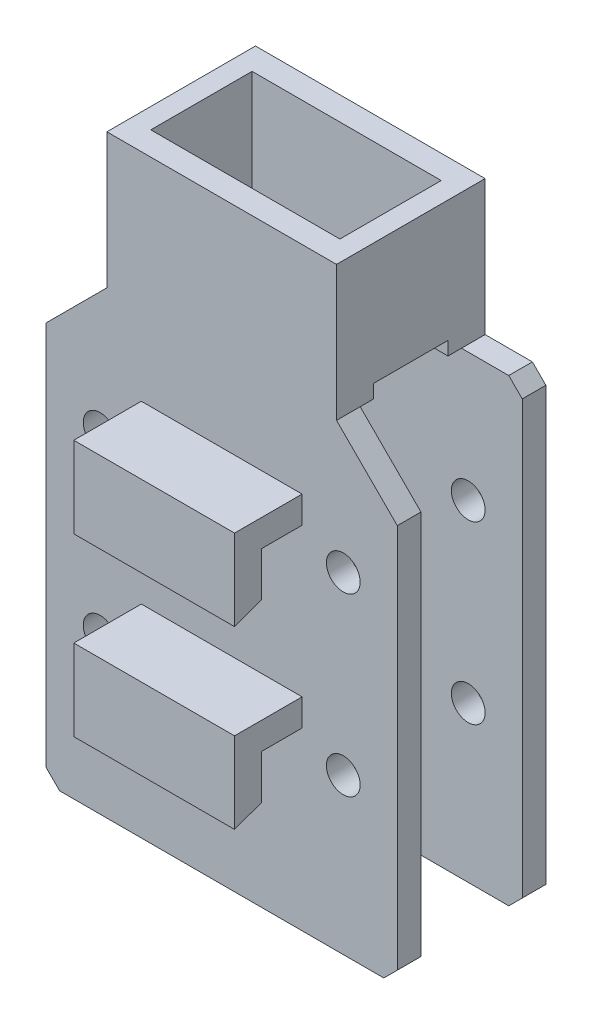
ISO-10303-21;
HEADER;
FILE_DESCRIPTION(('STEP AP214'),'2;1');
FILE_NAME('part.step','',(''),(''),'','','');
FILE_SCHEMA(('AUTOMOTIVE_DESIGN { 1 0 10303 214 1 1 1 1 }'));
ENDSEC;
DATA;
#1=APPLICATION_CONTEXT('core data for automotive mechanical design processes');
#2=APPLICATION_PROTOCOL_DEFINITION('international standard','automotive_design',2000,#1);
#3=PRODUCT_CONTEXT('',#1,'mechanical');
#4=PRODUCT('Part','Part','',(#3));
#5=PRODUCT_RELATED_PRODUCT_CATEGORY('part','',(#4));
#6=PRODUCT_DEFINITION_FORMATION('','',#4);
#7=PRODUCT_DEFINITION_CONTEXT('part definition',#1,'design');
#8=PRODUCT_DEFINITION('design','',#6,#7);
#9=PRODUCT_DEFINITION_SHAPE('','',#8);
#10=(LENGTH_UNIT() NAMED_UNIT(*) SI_UNIT(.MILLI.,.METRE.));
#11=(NAMED_UNIT(*) PLANE_ANGLE_UNIT() SI_UNIT($,.RADIAN.));
#12=(NAMED_UNIT(*) SI_UNIT($,.STERADIAN.) SOLID_ANGLE_UNIT());
#13=UNCERTAINTY_MEASURE_WITH_UNIT(LENGTH_MEASURE(1.E-05),#10,'distance_accuracy_value','');
#14=(GEOMETRIC_REPRESENTATION_CONTEXT(3) GLOBAL_UNCERTAINTY_ASSIGNED_CONTEXT((#13)) GLOBAL_UNIT_ASSIGNED_CONTEXT((#10,
#11,#12)) REPRESENTATION_CONTEXT('',''));
#15=CARTESIAN_POINT('',(0.,0.,0.));
#16=DIRECTION('',(0.,0.,1.));
#17=DIRECTION('',(1.,0.,0.));
#18=AXIS2_PLACEMENT_3D('',#15,#16,#17);
#19=CARTESIAN_POINT('',(0.,0.,-11.));
#20=DIRECTION('',(0.,0.,1.));
#21=DIRECTION('',(1.,0.,0.));
#22=AXIS2_PLACEMENT_3D('',#19,#20,#21);
#23=PLANE('',#22);
#24=CARTESIAN_POINT('',(-18.,-11.,-11.));
#25=DIRECTION('',(0.,0.,1.));
#26=DIRECTION('',(1.,0.,0.));
#27=AXIS2_PLACEMENT_3D('',#24,#25,#26);
#28=CIRCLE('',#27,2.5);
#29=CARTESIAN_POINT('',(-15.5,-11.,-11.));
#30=VERTEX_POINT('',#29);
#31=EDGE_CURVE('E522',#30,#30,#28,.T.);
#32=ORIENTED_EDGE('',*,*,#31,.T.);
#33=EDGE_LOOP('',(#32));
#34=FACE_BOUND('',#33,.T.);
#35=CARTESIAN_POINT('',(18.,-11.,-11.));
#36=DIRECTION('',(0.,0.,1.));
#37=DIRECTION('',(-1.,0.,0.));
#38=AXIS2_PLACEMENT_3D('',#35,#36,#37);
#39=CIRCLE('',#38,2.5);
#40=CARTESIAN_POINT('',(15.5,-11.,-11.));
#41=VERTEX_POINT('',#40);
#42=EDGE_CURVE('E533',#41,#41,#39,.T.);
#43=ORIENTED_EDGE('',*,*,#42,.T.);
#44=EDGE_LOOP('',(#43));
#45=FACE_BOUND('',#44,.T.);
#46=CARTESIAN_POINT('',(-18.,15.,-11.));
#47=DIRECTION('',(0.,0.,1.));
#48=DIRECTION('',(1.,0.,0.));
#49=AXIS2_PLACEMENT_3D('',#46,#47,#48);
#50=CIRCLE('',#49,2.5);
#51=CARTESIAN_POINT('',(-15.5,15.,-11.));
#52=VERTEX_POINT('',#51);
#53=EDGE_CURVE('E513',#52,#52,#50,.T.);
#54=ORIENTED_EDGE('',*,*,#53,.T.);
#55=EDGE_LOOP('',(#54));
#56=FACE_BOUND('',#55,.T.);
#57=CARTESIAN_POINT('',(18.,15.,-11.));
#58=DIRECTION('',(0.,0.,1.));
#59=DIRECTION('',(-1.,0.,0.));
#60=AXIS2_PLACEMENT_3D('',#57,#58,#59);
#61=CIRCLE('',#60,2.5);
#62=CARTESIAN_POINT('',(15.5,15.,-11.));
#63=VERTEX_POINT('',#62);
#64=EDGE_CURVE('E589',#63,#63,#61,.T.);
#65=ORIENTED_EDGE('',*,*,#64,.T.);
#66=EDGE_LOOP('',(#65));
#67=FACE_BOUND('',#66,.T.);
#68=DIRECTION('',(-1.,0.,0.));
#69=VECTOR('',#68,1.);
#70=CARTESIAN_POINT('',(24.,34.,-11.));
#71=LINE('',#70,#69);
#72=CARTESIAN_POINT('',(24.,34.,-11.));
#73=VERTEX_POINT('',#72);
#74=CARTESIAN_POINT('',(17.,34.,-11.));
#75=VERTEX_POINT('',#74);
#76=EDGE_CURVE('E479',#73,#75,#71,.T.);
#77=ORIENTED_EDGE('',*,*,#76,.F.);
#78=DIRECTION('',(-0.707106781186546,0.707106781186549,0.));
#79=VECTOR('',#78,1.);
#80=CARTESIAN_POINT('',(26.,32.,-11.));
#81=LINE('',#80,#79);
#82=CARTESIAN_POINT('',(26.,32.,-11.));
#83=VERTEX_POINT('',#82);
#84=EDGE_CURVE('E450',#83,#73,#81,.T.);
#85=ORIENTED_EDGE('',*,*,#84,.F.);
#86=DIRECTION('',(0.,1.,0.));
#87=VECTOR('',#86,1.);
#88=CARTESIAN_POINT('',(26.,32.,-11.));
#89=LINE('',#88,#87);
#90=CARTESIAN_POINT('',(26.,-32.,-11.));
#91=VERTEX_POINT('',#90);
#92=EDGE_CURVE('E455',#91,#83,#89,.T.);
#93=ORIENTED_EDGE('',*,*,#92,.F.);
#94=DIRECTION('',(0.707106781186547,0.707106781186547,0.));
#95=VECTOR('',#94,1.);
#96=CARTESIAN_POINT('',(26.,-32.,-11.));
#97=LINE('',#96,#95);
#98=CARTESIAN_POINT('',(24.,-34.,-11.));
#99=VERTEX_POINT('',#98);
#100=EDGE_CURVE('E459',#99,#91,#97,.T.);
#101=ORIENTED_EDGE('',*,*,#100,.F.);
#102=DIRECTION('',(1.,0.,0.));
#103=VECTOR('',#102,1.);
#104=CARTESIAN_POINT('',(24.,-34.,-11.));
#105=LINE('',#104,#103);
#106=CARTESIAN_POINT('',(-24.,-34.,-11.));
#107=VERTEX_POINT('',#106);
#108=EDGE_CURVE('E463',#107,#99,#105,.T.);
#109=ORIENTED_EDGE('',*,*,#108,.F.);
#110=DIRECTION('',(0.707106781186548,-0.707106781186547,0.));
#111=VECTOR('',#110,1.);
#112=CARTESIAN_POINT('',(-24.,-34.,-11.));
#113=LINE('',#112,#111);
#114=CARTESIAN_POINT('',(-26.,-32.,-11.));
#115=VERTEX_POINT('',#114);
#116=EDGE_CURVE('E467',#115,#107,#113,.T.);
#117=ORIENTED_EDGE('',*,*,#116,.F.);
#118=DIRECTION('',(0.,-1.,0.));
#119=VECTOR('',#118,1.);
#120=CARTESIAN_POINT('',(-26.,32.,-11.));
#121=LINE('',#120,#119);
#122=CARTESIAN_POINT('',(-26.,32.,-11.));
#123=VERTEX_POINT('',#122);
#124=EDGE_CURVE('E471',#123,#115,#121,.T.);
#125=ORIENTED_EDGE('',*,*,#124,.F.);
#126=DIRECTION('',(-0.707106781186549,-0.707106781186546,0.));
#127=VECTOR('',#126,1.);
#128=CARTESIAN_POINT('',(-24.,34.,-11.));
#129=LINE('',#128,#127);
#130=CARTESIAN_POINT('',(-24.,34.,-11.));
#131=VERTEX_POINT('',#130);
#132=EDGE_CURVE('E475',#131,#123,#129,.T.);
#133=ORIENTED_EDGE('',*,*,#132,.F.);
#134=CARTESIAN_POINT('',(-17.,34.,-11.));
#135=VERTEX_POINT('',#134);
#136=EDGE_CURVE('E481',#135,#131,#71,.T.);
#137=ORIENTED_EDGE('',*,*,#136,.F.);
#138=DIRECTION('',(0.,-1.,0.));
#139=VECTOR('',#138,1.);
#140=CARTESIAN_POINT('',(-17.,54.,-11.));
#141=LINE('',#140,#139);
#142=CARTESIAN_POINT('',(-17.,54.,-11.));
#143=VERTEX_POINT('',#142);
#144=EDGE_CURVE('E435',#143,#135,#141,.T.);
#145=ORIENTED_EDGE('',*,*,#144,.F.);
#146=DIRECTION('',(-1.,0.,0.));
#147=VECTOR('',#146,1.);
#148=CARTESIAN_POINT('',(17.,54.,-11.));
#149=LINE('',#148,#147);
#150=CARTESIAN_POINT('',(17.,54.,-11.));
#151=VERTEX_POINT('',#150);
#152=EDGE_CURVE('E433',#151,#143,#149,.T.);
#153=ORIENTED_EDGE('',*,*,#152,.F.);
#154=DIRECTION('',(0.,-1.,0.));
#155=VECTOR('',#154,1.);
#156=CARTESIAN_POINT('',(17.,54.,-11.));
#157=LINE('',#156,#155);
#158=EDGE_CURVE('E442',#151,#75,#157,.T.);
#159=ORIENTED_EDGE('',*,*,#158,.T.);
#160=EDGE_LOOP('',(#77,#85,#93,#101,#109,#117,#125,#133,#137,#145,#153,#159));
#161=FACE_BOUND('',#160,.T.);
#162=CARTESIAN_POINT('',(0.,-22.,-11.));
#163=DIRECTION('',(0.,0.,1.));
#164=DIRECTION('',(1.,0.,0.));
#165=AXIS2_PLACEMENT_3D('',#162,#163,#164);
#166=CIRCLE('',#165,3.4);
#167=CARTESIAN_POINT('',(3.4,-22.,-11.));
#168=VERTEX_POINT('',#167);
#169=EDGE_CURVE('E753',#168,#168,#166,.F.);
#170=ORIENTED_EDGE('',*,*,#169,.F.);
#171=EDGE_LOOP('',(#170));
#172=FACE_BOUND('',#171,.T.);
#173=ADVANCED_FACE('F38',(#34,#45,#56,#67,#161,#172),#23,.F.);
#174=CARTESIAN_POINT('',(0.,34.,0.));
#175=DIRECTION('',(0.,-1.,0.));
#176=DIRECTION('',(1.,0.,0.));
#177=AXIS2_PLACEMENT_3D('',#174,#175,#176);
#178=PLANE('',#177);
#179=DIRECTION('',(1.,0.,0.));
#180=VECTOR('',#179,1.);
#181=CARTESIAN_POINT('',(0.,34.,-5.5));
#182=LINE('',#181,#180);
#183=CARTESIAN_POINT('',(14.,34.,-5.5));
#184=VERTEX_POINT('',#183);
#185=CARTESIAN_POINT('',(17.,34.,-5.5));
#186=VERTEX_POINT('',#185);
#187=EDGE_CURVE('E573',#184,#186,#182,.T.);
#188=ORIENTED_EDGE('',*,*,#187,.F.);
#189=DIRECTION('',(0.,0.,-1.));
#190=VECTOR('',#189,1.);
#191=CARTESIAN_POINT('',(14.,34.,-7.5));
#192=LINE('',#191,#190);
#193=CARTESIAN_POINT('',(14.,34.,-7.5));
#194=VERTEX_POINT('',#193);
#195=EDGE_CURVE('E415',#184,#194,#192,.T.);
#196=ORIENTED_EDGE('',*,*,#195,.T.);
#197=DIRECTION('',(-1.,0.,0.));
#198=VECTOR('',#197,1.);
#199=CARTESIAN_POINT('',(24.,34.,-7.5));
#200=LINE('',#199,#198);
#201=CARTESIAN_POINT('',(17.,34.,-7.5));
#202=VERTEX_POINT('',#201);
#203=EDGE_CURVE('E497',#202,#194,#200,.T.);
#204=ORIENTED_EDGE('',*,*,#203,.F.);
#205=DIRECTION('',(0.,0.,-1.));
#206=VECTOR('',#205,1.);
#207=CARTESIAN_POINT('',(17.,34.,-11.));
#208=LINE('',#207,#206);
#209=EDGE_CURVE('E340',#186,#202,#208,.T.);
#210=ORIENTED_EDGE('',*,*,#209,.F.);
#211=EDGE_LOOP('',(#188,#196,#204,#210));
#212=FACE_BOUND('',#211,.T.);
#213=ADVANCED_FACE('F630',(#212),#178,.T.);
#214=DIRECTION('',(1.,0.,0.));
#215=VECTOR('',#214,1.);
#216=CARTESIAN_POINT('',(0.,34.,-5.5));
#217=LINE('',#216,#215);
#218=CARTESIAN_POINT('',(-17.,34.,-5.5));
#219=VERTEX_POINT('',#218);
#220=CARTESIAN_POINT('',(-14.,34.,-5.5));
#221=VERTEX_POINT('',#220);
#222=EDGE_CURVE('E580',#219,#221,#217,.T.);
#223=ORIENTED_EDGE('',*,*,#222,.F.);
#224=DIRECTION('',(0.,0.,1.));
#225=VECTOR('',#224,1.);
#226=CARTESIAN_POINT('',(-17.,34.,-11.));
#227=LINE('',#226,#225);
#228=CARTESIAN_POINT('',(-17.,34.,-7.5));
#229=VERTEX_POINT('',#228);
#230=EDGE_CURVE('E438',#229,#219,#227,.T.);
#231=ORIENTED_EDGE('',*,*,#230,.F.);
#232=CARTESIAN_POINT('',(-14.,34.,-7.5));
#233=VERTEX_POINT('',#232);
#234=EDGE_CURVE('E632',#233,#229,#200,.T.);
#235=ORIENTED_EDGE('',*,*,#234,.F.);
#236=DIRECTION('',(0.,0.,1.));
#237=VECTOR('',#236,1.);
#238=CARTESIAN_POINT('',(-14.,34.,-7.5));
#239=LINE('',#238,#237);
#240=EDGE_CURVE('E412',#233,#221,#239,.T.);
#241=ORIENTED_EDGE('',*,*,#240,.T.);
#242=EDGE_LOOP('',(#223,#231,#235,#241));
#243=FACE_BOUND('',#242,.T.);
#244=ADVANCED_FACE('F853',(#243),#178,.T.);
#245=DIRECTION('',(-1.,0.,0.));
#246=VECTOR('',#245,1.);
#247=CARTESIAN_POINT('',(0.,34.,5.5));
#248=LINE('',#247,#246);
#249=CARTESIAN_POINT('',(17.,34.,5.5));
#250=VERTEX_POINT('',#249);
#251=CARTESIAN_POINT('',(14.,34.,5.49999999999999));
#252=VERTEX_POINT('',#251);
#253=EDGE_CURVE('E337',#250,#252,#248,.T.);
#254=ORIENTED_EDGE('',*,*,#253,.F.);
#255=CARTESIAN_POINT('',(17.,34.,7.5));
#256=VERTEX_POINT('',#255);
#257=EDGE_CURVE('E333',#256,#250,#208,.T.);
#258=ORIENTED_EDGE('',*,*,#257,.F.);
#259=DIRECTION('',(-1.,0.,0.));
#260=VECTOR('',#259,1.);
#261=CARTESIAN_POINT('',(24.,34.,7.5));
#262=LINE('',#261,#260);
#263=CARTESIAN_POINT('',(14.,34.,7.5));
#264=VERTEX_POINT('',#263);
#265=EDGE_CURVE('E336',#256,#264,#262,.T.);
#266=ORIENTED_EDGE('',*,*,#265,.T.);
#267=EDGE_CURVE('E404',#264,#252,#192,.T.);
#268=ORIENTED_EDGE('',*,*,#267,.T.);
#269=EDGE_LOOP('',(#254,#258,#266,#268));
#270=FACE_BOUND('',#269,.T.);
#271=ADVANCED_FACE('F334',(#270),#178,.T.);
#272=DIRECTION('',(-1.,0.,0.));
#273=VECTOR('',#272,1.);
#274=CARTESIAN_POINT('',(0.,34.,5.5));
#275=LINE('',#274,#273);
#276=CARTESIAN_POINT('',(-14.,34.,5.5));
#277=VERTEX_POINT('',#276);
#278=CARTESIAN_POINT('',(-17.,34.,5.5));
#279=VERTEX_POINT('',#278);
#280=EDGE_CURVE('E560',#277,#279,#275,.T.);
#281=ORIENTED_EDGE('',*,*,#280,.F.);
#282=CARTESIAN_POINT('',(-14.,34.,7.5));
#283=VERTEX_POINT('',#282);
#284=EDGE_CURVE('E400',#277,#283,#239,.T.);
#285=ORIENTED_EDGE('',*,*,#284,.T.);
#286=CARTESIAN_POINT('',(-17.,34.,7.5));
#287=VERTEX_POINT('',#286);
#288=EDGE_CURVE('E356',#283,#287,#262,.T.);
#289=ORIENTED_EDGE('',*,*,#288,.T.);
#290=EDGE_CURVE('E426',#279,#287,#227,.T.);
#291=ORIENTED_EDGE('',*,*,#290,.F.);
#292=EDGE_LOOP('',(#281,#285,#289,#291));
#293=FACE_BOUND('',#292,.T.);
#294=ADVANCED_FACE('F848',(#293),#178,.T.);
#295=CARTESIAN_POINT('',(24.,34.,11.));
#296=DIRECTION('',(0.,-1.,0.));
#297=DIRECTION('',(1.,0.,0.));
#298=AXIS2_PLACEMENT_3D('',#295,#296,#297);
#299=PLANE('',#298);
#300=EDGE_CURVE('E436',#135,#229,#227,.T.);
#301=ORIENTED_EDGE('',*,*,#300,.F.);
#302=ORIENTED_EDGE('',*,*,#136,.T.);
#303=DIRECTION('',(0.,0.,-1.));
#304=VECTOR('',#303,1.);
#305=CARTESIAN_POINT('',(-24.,34.,11.));
#306=LINE('',#305,#304);
#307=CARTESIAN_POINT('',(-24.,34.,-7.5));
#308=VERTEX_POINT('',#307);
#309=EDGE_CURVE('E478',#308,#131,#306,.T.);
#310=ORIENTED_EDGE('',*,*,#309,.F.);
#311=EDGE_CURVE('E498',#229,#308,#200,.T.);
#312=ORIENTED_EDGE('',*,*,#311,.F.);
#313=EDGE_LOOP('',(#301,#302,#310,#312));
#314=FACE_BOUND('',#313,.T.);
#315=ADVANCED_FACE('F40',(#314),#299,.F.);
#316=EDGE_CURVE('E342',#202,#75,#208,.T.);
#317=ORIENTED_EDGE('',*,*,#316,.F.);
#318=CARTESIAN_POINT('',(24.,34.,-7.5));
#319=VERTEX_POINT('',#318);
#320=EDGE_CURVE('E494',#319,#202,#200,.T.);
#321=ORIENTED_EDGE('',*,*,#320,.F.);
#322=DIRECTION('',(0.,0.,-1.));
#323=VECTOR('',#322,1.);
#324=CARTESIAN_POINT('',(24.,34.,11.));
#325=LINE('',#324,#323);
#326=EDGE_CURVE('E449',#319,#73,#325,.T.);
#327=ORIENTED_EDGE('',*,*,#326,.T.);
#328=ORIENTED_EDGE('',*,*,#76,.T.);
#329=EDGE_LOOP('',(#317,#321,#327,#328));
#330=FACE_BOUND('',#329,.T.);
#331=ADVANCED_FACE('F618',(#330),#299,.F.);
#332=CARTESIAN_POINT('',(-24.,34.,11.));
#333=DIRECTION('',(0.707106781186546,-0.707106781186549,0.));
#334=DIRECTION('',(0.707106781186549,0.707106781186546,0.));
#335=AXIS2_PLACEMENT_3D('',#332,#333,#334);
#336=PLANE('',#335);
#337=DIRECTION('',(-0.707106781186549,-0.707106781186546,0.));
#338=VECTOR('',#337,1.);
#339=CARTESIAN_POINT('',(-24.,34.,-7.5));
#340=LINE('',#339,#338);
#341=CARTESIAN_POINT('',(-26.,32.,-7.5));
#342=VERTEX_POINT('',#341);
#343=EDGE_CURVE('E492',#308,#342,#340,.T.);
#344=ORIENTED_EDGE('',*,*,#343,.F.);
#345=ORIENTED_EDGE('',*,*,#309,.T.);
#346=ORIENTED_EDGE('',*,*,#132,.T.);
#347=DIRECTION('',(0.,0.,-1.));
#348=VECTOR('',#347,1.);
#349=CARTESIAN_POINT('',(-26.,32.,11.));
#350=LINE('',#349,#348);
#351=EDGE_CURVE('E474',#342,#123,#350,.T.);
#352=ORIENTED_EDGE('',*,*,#351,.F.);
#353=EDGE_LOOP('',(#344,#345,#346,#352));
#354=FACE_BOUND('',#353,.T.);
#355=ADVANCED_FACE('F641',(#354),#336,.F.);
#356=CARTESIAN_POINT('',(-26.,32.,11.));
#357=DIRECTION('',(1.,0.,0.));
#358=DIRECTION('',(0.,1.,0.));
#359=AXIS2_PLACEMENT_3D('',#356,#357,#358);
#360=PLANE('',#359);
#361=DIRECTION('',(0.,-1.,0.));
#362=VECTOR('',#361,1.);
#363=CARTESIAN_POINT('',(-26.,32.,-7.5));
#364=LINE('',#363,#362);
#365=CARTESIAN_POINT('',(-26.,-32.,-7.5));
#366=VERTEX_POINT('',#365);
#367=EDGE_CURVE('E490',#342,#366,#364,.T.);
#368=ORIENTED_EDGE('',*,*,#367,.F.);
#369=ORIENTED_EDGE('',*,*,#351,.T.);
#370=ORIENTED_EDGE('',*,*,#124,.T.);
#371=DIRECTION('',(0.,0.,-1.));
#372=VECTOR('',#371,1.);
#373=CARTESIAN_POINT('',(-26.,-32.,11.));
#374=LINE('',#373,#372);
#375=EDGE_CURVE('E470',#366,#115,#374,.T.);
#376=ORIENTED_EDGE('',*,*,#375,.F.);
#377=EDGE_LOOP('',(#368,#369,#370,#376));
#378=FACE_BOUND('',#377,.T.);
#379=ADVANCED_FACE('F837',(#378),#360,.F.);
#380=CARTESIAN_POINT('',(-24.,-34.,11.));
#381=DIRECTION('',(0.707106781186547,0.707106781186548,0.));
#382=DIRECTION('',(-0.707106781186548,0.707106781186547,0.));
#383=AXIS2_PLACEMENT_3D('',#380,#381,#382);
#384=PLANE('',#383);
#385=DIRECTION('',(0.707106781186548,-0.707106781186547,0.));
#386=VECTOR('',#385,1.);
#387=CARTESIAN_POINT('',(-26.,-32.,-7.5));
#388=LINE('',#387,#386);
#389=CARTESIAN_POINT('',(-24.,-34.,-7.5));
#390=VERTEX_POINT('',#389);
#391=EDGE_CURVE('E488',#366,#390,#388,.T.);
#392=ORIENTED_EDGE('',*,*,#391,.F.);
#393=ORIENTED_EDGE('',*,*,#375,.T.);
#394=ORIENTED_EDGE('',*,*,#116,.T.);
#395=DIRECTION('',(0.,0.,-1.));
#396=VECTOR('',#395,1.);
#397=CARTESIAN_POINT('',(-24.,-34.,11.));
#398=LINE('',#397,#396);
#399=EDGE_CURVE('E466',#390,#107,#398,.T.);
#400=ORIENTED_EDGE('',*,*,#399,.F.);
#401=EDGE_LOOP('',(#392,#393,#394,#400));
#402=FACE_BOUND('',#401,.T.);
#403=ADVANCED_FACE('F833',(#402),#384,.F.);
#404=CARTESIAN_POINT('',(24.,-34.,11.));
#405=DIRECTION('',(0.,1.,0.));
#406=DIRECTION('',(0.,0.,1.));
#407=AXIS2_PLACEMENT_3D('',#404,#405,#406);
#408=PLANE('',#407);
#409=DIRECTION('',(1.,0.,0.));
#410=VECTOR('',#409,1.);
#411=CARTESIAN_POINT('',(-24.,-34.,-7.5));
#412=LINE('',#411,#410);
#413=CARTESIAN_POINT('',(24.,-34.,-7.5));
#414=VERTEX_POINT('',#413);
#415=EDGE_CURVE('E486',#390,#414,#412,.T.);
#416=ORIENTED_EDGE('',*,*,#415,.F.);
#417=ORIENTED_EDGE('',*,*,#399,.T.);
#418=ORIENTED_EDGE('',*,*,#108,.T.);
#419=DIRECTION('',(0.,0.,-1.));
#420=VECTOR('',#419,1.);
#421=CARTESIAN_POINT('',(24.,-34.,11.));
#422=LINE('',#421,#420);
#423=EDGE_CURVE('E462',#414,#99,#422,.T.);
#424=ORIENTED_EDGE('',*,*,#423,.F.);
#425=EDGE_LOOP('',(#416,#417,#418,#424));
#426=FACE_BOUND('',#425,.T.);
#427=ADVANCED_FACE('F829',(#426),#408,.F.);
#428=CARTESIAN_POINT('',(26.,-32.,11.));
#429=DIRECTION('',(-0.707106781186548,0.707106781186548,0.));
#430=DIRECTION('',(-0.707106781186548,-0.707106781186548,0.));
#431=AXIS2_PLACEMENT_3D('',#428,#429,#430);
#432=PLANE('',#431);
#433=DIRECTION('',(0.707106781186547,0.707106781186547,0.));
#434=VECTOR('',#433,1.);
#435=CARTESIAN_POINT('',(24.,-34.,-7.5));
#436=LINE('',#435,#434);
#437=CARTESIAN_POINT('',(26.,-32.,-7.5));
#438=VERTEX_POINT('',#437);
#439=EDGE_CURVE('E484',#414,#438,#436,.T.);
#440=ORIENTED_EDGE('',*,*,#439,.F.);
#441=ORIENTED_EDGE('',*,*,#423,.T.);
#442=ORIENTED_EDGE('',*,*,#100,.T.);
#443=DIRECTION('',(0.,0.,-1.));
#444=VECTOR('',#443,1.);
#445=CARTESIAN_POINT('',(26.,-32.,11.));
#446=LINE('',#445,#444);
#447=EDGE_CURVE('E458',#438,#91,#446,.T.);
#448=ORIENTED_EDGE('',*,*,#447,.F.);
#449=EDGE_LOOP('',(#440,#441,#442,#448));
#450=FACE_BOUND('',#449,.T.);
#451=ADVANCED_FACE('F825',(#450),#432,.F.);
#452=CARTESIAN_POINT('',(26.,32.,11.));
#453=DIRECTION('',(-1.,0.,0.));
#454=DIRECTION('',(0.,-1.,0.));
#455=AXIS2_PLACEMENT_3D('',#452,#453,#454);
#456=PLANE('',#455);
#457=DIRECTION('',(0.,1.,0.));
#458=VECTOR('',#457,1.);
#459=CARTESIAN_POINT('',(26.,-32.,-7.5));
#460=LINE('',#459,#458);
#461=CARTESIAN_POINT('',(26.,32.,-7.5));
#462=VERTEX_POINT('',#461);
#463=EDGE_CURVE('E482',#438,#462,#460,.T.);
#464=ORIENTED_EDGE('',*,*,#463,.F.);
#465=ORIENTED_EDGE('',*,*,#447,.T.);
#466=ORIENTED_EDGE('',*,*,#92,.T.);
#467=DIRECTION('',(0.,0.,-1.));
#468=VECTOR('',#467,1.);
#469=CARTESIAN_POINT('',(26.,32.,11.));
#470=LINE('',#469,#468);
#471=EDGE_CURVE('E454',#462,#83,#470,.T.);
#472=ORIENTED_EDGE('',*,*,#471,.F.);
#473=EDGE_LOOP('',(#464,#465,#466,#472));
#474=FACE_BOUND('',#473,.T.);
#475=ADVANCED_FACE('F822',(#474),#456,.F.);
#476=CARTESIAN_POINT('',(26.,32.,11.));
#477=DIRECTION('',(-0.707106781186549,-0.707106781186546,0.));
#478=DIRECTION('',(0.707106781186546,-0.707106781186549,0.));
#479=AXIS2_PLACEMENT_3D('',#476,#477,#478);
#480=PLANE('',#479);
#481=DIRECTION('',(-0.707106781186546,0.707106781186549,0.));
#482=VECTOR('',#481,1.);
#483=CARTESIAN_POINT('',(26.,32.,-7.5));
#484=LINE('',#483,#482);
#485=EDGE_CURVE('E453',#462,#319,#484,.T.);
#486=ORIENTED_EDGE('',*,*,#485,.F.);
#487=ORIENTED_EDGE('',*,*,#471,.T.);
#488=ORIENTED_EDGE('',*,*,#84,.T.);
#489=ORIENTED_EDGE('',*,*,#326,.F.);
#490=EDGE_LOOP('',(#486,#487,#488,#489));
#491=FACE_BOUND('',#490,.T.);
#492=ADVANCED_FACE('F605',(#491),#480,.F.);
#493=CARTESIAN_POINT('',(0.,0.,-7.5));
#494=DIRECTION('',(0.,0.,1.));
#495=DIRECTION('',(1.,0.,0.));
#496=AXIS2_PLACEMENT_3D('',#493,#494,#495);
#497=PLANE('',#496);
#498=CARTESIAN_POINT('',(0.,-22.,-7.5));
#499=DIRECTION('',(0.,0.,1.));
#500=DIRECTION('',(1.,0.,0.));
#501=AXIS2_PLACEMENT_3D('',#498,#499,#500);
#502=CIRCLE('',#501,3.4);
#503=CARTESIAN_POINT('',(3.4,-22.,-7.5));
#504=VERTEX_POINT('',#503);
#505=EDGE_CURVE('E536',#504,#504,#502,.T.);
#506=ORIENTED_EDGE('',*,*,#505,.F.);
#507=EDGE_LOOP('',(#506));
#508=FACE_BOUND('',#507,.T.);
#509=CARTESIAN_POINT('',(-18.,-11.,-7.5));
#510=DIRECTION('',(0.,0.,1.));
#511=DIRECTION('',(1.,0.,0.));
#512=AXIS2_PLACEMENT_3D('',#509,#510,#511);
#513=CIRCLE('',#512,2.5);
#514=CARTESIAN_POINT('',(-15.5,-11.,-7.5));
#515=VERTEX_POINT('',#514);
#516=EDGE_CURVE('E544',#515,#515,#513,.T.);
#517=ORIENTED_EDGE('',*,*,#516,.F.);
#518=EDGE_LOOP('',(#517));
#519=FACE_BOUND('',#518,.T.);
#520=CARTESIAN_POINT('',(18.,-11.,-7.5));
#521=DIRECTION('',(0.,0.,1.));
#522=DIRECTION('',(1.,0.,0.));
#523=AXIS2_PLACEMENT_3D('',#520,#521,#522);
#524=CIRCLE('',#523,2.5);
#525=CARTESIAN_POINT('',(20.5,-11.,-7.5));
#526=VERTEX_POINT('',#525);
#527=EDGE_CURVE('E521',#526,#526,#524,.T.);
#528=ORIENTED_EDGE('',*,*,#527,.F.);
#529=EDGE_LOOP('',(#528));
#530=FACE_BOUND('',#529,.T.);
#531=CARTESIAN_POINT('',(-18.,15.,-7.5));
#532=DIRECTION('',(0.,0.,1.));
#533=DIRECTION('',(1.,0.,0.));
#534=AXIS2_PLACEMENT_3D('',#531,#532,#533);
#535=CIRCLE('',#534,2.5);
#536=CARTESIAN_POINT('',(-15.5,15.,-7.5));
#537=VERTEX_POINT('',#536);
#538=EDGE_CURVE('E361',#537,#537,#535,.T.);
#539=ORIENTED_EDGE('',*,*,#538,.F.);
#540=EDGE_LOOP('',(#539));
#541=FACE_BOUND('',#540,.T.);
#542=CARTESIAN_POINT('',(18.,15.,-7.5));
#543=DIRECTION('',(0.,0.,1.));
#544=DIRECTION('',(1.,0.,0.));
#545=AXIS2_PLACEMENT_3D('',#542,#543,#544);
#546=CIRCLE('',#545,2.5);
#547=CARTESIAN_POINT('',(20.5,15.,-7.5));
#548=VERTEX_POINT('',#547);
#549=EDGE_CURVE('E512',#548,#548,#546,.T.);
#550=ORIENTED_EDGE('',*,*,#549,.F.);
#551=EDGE_LOOP('',(#550));
#552=FACE_BOUND('',#551,.T.);
#553=ORIENTED_EDGE('',*,*,#485,.T.);
#554=ORIENTED_EDGE('',*,*,#320,.T.);
#555=ORIENTED_EDGE('',*,*,#203,.T.);
#556=DIRECTION('',(0.,-1.,0.));
#557=VECTOR('',#556,1.);
#558=CARTESIAN_POINT('',(14.,54.,-7.5));
#559=LINE('',#558,#557);
#560=CARTESIAN_POINT('',(14.,54.,-7.5));
#561=VERTEX_POINT('',#560);
#562=EDGE_CURVE('E419',#561,#194,#559,.T.);
#563=ORIENTED_EDGE('',*,*,#562,.F.);
#564=DIRECTION('',(-1.,0.,0.));
#565=VECTOR('',#564,1.);
#566=CARTESIAN_POINT('',(14.,54.,-7.5));
#567=LINE('',#566,#565);
#568=CARTESIAN_POINT('',(-14.,54.,-7.5));
#569=VERTEX_POINT('',#568);
#570=EDGE_CURVE('E409',#561,#569,#567,.T.);
#571=ORIENTED_EDGE('',*,*,#570,.T.);
#572=DIRECTION('',(0.,-1.,0.));
#573=VECTOR('',#572,1.);
#574=CARTESIAN_POINT('',(-14.,54.,-7.5));
#575=LINE('',#574,#573);
#576=EDGE_CURVE('E411',#569,#233,#575,.T.);
#577=ORIENTED_EDGE('',*,*,#576,.T.);
#578=ORIENTED_EDGE('',*,*,#234,.T.);
#579=ORIENTED_EDGE('',*,*,#311,.T.);
#580=ORIENTED_EDGE('',*,*,#343,.T.);
#581=ORIENTED_EDGE('',*,*,#367,.T.);
#582=ORIENTED_EDGE('',*,*,#391,.T.);
#583=ORIENTED_EDGE('',*,*,#415,.T.);
#584=ORIENTED_EDGE('',*,*,#439,.T.);
#585=ORIENTED_EDGE('',*,*,#463,.T.);
#586=EDGE_LOOP('',(#553,#554,#555,#563,#571,#577,#578,#579,#580,#581,#582,#583,#584,#585));
#587=FACE_BOUND('',#586,.T.);
#588=ADVANCED_FACE('F601',(#508,#519,#530,#541,#552,#587),#497,.T.);
#589=CARTESIAN_POINT('',(0.,54.,0.));
#590=DIRECTION('',(0.,-1.,0.));
#591=DIRECTION('',(1.,0.,0.));
#592=AXIS2_PLACEMENT_3D('',#589,#590,#591);
#593=PLANE('',#592);
#594=DIRECTION('',(0.,0.,1.));
#595=VECTOR('',#594,1.);
#596=CARTESIAN_POINT('',(-17.,54.,-11.));
#597=LINE('',#596,#595);
#598=CARTESIAN_POINT('',(-17.,54.,11.));
#599=VERTEX_POINT('',#598);
#600=EDGE_CURVE('E349',#143,#599,#597,.T.);
#601=ORIENTED_EDGE('',*,*,#600,.T.);
#602=DIRECTION('',(1.,0.,0.));
#603=VECTOR('',#602,1.);
#604=CARTESIAN_POINT('',(17.,54.,11.));
#605=LINE('',#604,#603);
#606=CARTESIAN_POINT('',(17.,54.,11.));
#607=VERTEX_POINT('',#606);
#608=EDGE_CURVE('E429',#599,#607,#605,.T.);
#609=ORIENTED_EDGE('',*,*,#608,.T.);
#610=DIRECTION('',(0.,0.,-1.));
#611=VECTOR('',#610,1.);
#612=CARTESIAN_POINT('',(17.,54.,-11.));
#613=LINE('',#612,#611);
#614=EDGE_CURVE('E431',#607,#151,#613,.T.);
#615=ORIENTED_EDGE('',*,*,#614,.T.);
#616=ORIENTED_EDGE('',*,*,#152,.T.);
#617=EDGE_LOOP('',(#601,#609,#615,#616));
#618=FACE_BOUND('',#617,.T.);
#619=DIRECTION('',(0.,0.,1.));
#620=VECTOR('',#619,1.);
#621=CARTESIAN_POINT('',(-14.,54.,-7.5));
#622=LINE('',#621,#620);
#623=CARTESIAN_POINT('',(-14.,54.,7.5));
#624=VERTEX_POINT('',#623);
#625=EDGE_CURVE('E401',#569,#624,#622,.T.);
#626=ORIENTED_EDGE('',*,*,#625,.F.);
#627=ORIENTED_EDGE('',*,*,#570,.F.);
#628=DIRECTION('',(0.,0.,-1.));
#629=VECTOR('',#628,1.);
#630=CARTESIAN_POINT('',(14.,54.,-7.5));
#631=LINE('',#630,#629);
#632=CARTESIAN_POINT('',(14.,54.,7.5));
#633=VERTEX_POINT('',#632);
#634=EDGE_CURVE('E406',#633,#561,#631,.T.);
#635=ORIENTED_EDGE('',*,*,#634,.F.);
#636=DIRECTION('',(1.,0.,0.));
#637=VECTOR('',#636,1.);
#638=CARTESIAN_POINT('',(14.,54.,7.5));
#639=LINE('',#638,#637);
#640=EDGE_CURVE('E403',#624,#633,#639,.T.);
#641=ORIENTED_EDGE('',*,*,#640,.F.);
#642=EDGE_LOOP('',(#626,#627,#635,#641));
#643=FACE_BOUND('',#642,.T.);
#644=ADVANCED_FACE('F604',(#618,#643),#593,.F.);
#645=CARTESIAN_POINT('',(-17.,54.,-11.));
#646=DIRECTION('',(1.,0.,0.));
#647=DIRECTION('',(0.,1.,0.));
#648=AXIS2_PLACEMENT_3D('',#645,#646,#647);
#649=PLANE('',#648);
#650=ORIENTED_EDGE('',*,*,#230,.T.);
#651=DIRECTION('',(0.,1.,0.));
#652=VECTOR('',#651,1.);
#653=CARTESIAN_POINT('',(-17.,54.,-5.5));
#654=LINE('',#653,#652);
#655=CARTESIAN_POINT('',(-17.,36.,-5.5));
#656=VERTEX_POINT('',#655);
#657=EDGE_CURVE('E582',#219,#656,#654,.T.);
#658=ORIENTED_EDGE('',*,*,#657,.T.);
#659=DIRECTION('',(0.,0.,1.));
#660=VECTOR('',#659,1.);
#661=CARTESIAN_POINT('',(-17.,36.,-11.));
#662=LINE('',#661,#660);
#663=CARTESIAN_POINT('',(-17.,36.,5.5));
#664=VERTEX_POINT('',#663);
#665=EDGE_CURVE('E570',#656,#664,#662,.T.);
#666=ORIENTED_EDGE('',*,*,#665,.T.);
#667=DIRECTION('',(0.,-1.,0.));
#668=VECTOR('',#667,1.);
#669=CARTESIAN_POINT('',(-17.,54.,5.5));
#670=LINE('',#669,#668);
#671=EDGE_CURVE('E562',#664,#279,#670,.T.);
#672=ORIENTED_EDGE('',*,*,#671,.T.);
#673=ORIENTED_EDGE('',*,*,#290,.T.);
#674=DIRECTION('',(0.,0.,-1.));
#675=VECTOR('',#674,1.);
#676=CARTESIAN_POINT('',(-17.,34.,-11.));
#677=LINE('',#676,#675);
#678=CARTESIAN_POINT('',(-17.0000000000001,34.,11.));
#679=VERTEX_POINT('',#678);
#680=EDGE_CURVE('E398',#679,#287,#677,.T.);
#681=ORIENTED_EDGE('',*,*,#680,.F.);
#682=DIRECTION('',(0.,-1.,0.));
#683=VECTOR('',#682,1.);
#684=CARTESIAN_POINT('',(-17.,54.,11.));
#685=LINE('',#684,#683);
#686=EDGE_CURVE('E446',#599,#679,#685,.T.);
#687=ORIENTED_EDGE('',*,*,#686,.F.);
#688=ORIENTED_EDGE('',*,*,#600,.F.);
#689=ORIENTED_EDGE('',*,*,#144,.T.);
#690=ORIENTED_EDGE('',*,*,#300,.T.);
#691=EDGE_LOOP('',(#650,#658,#666,#672,#673,#681,#687,#688,#689,#690));
#692=FACE_BOUND('',#691,.T.);
#693=ADVANCED_FACE('F649',(#692),#649,.F.);
#694=CARTESIAN_POINT('',(17.,54.,11.));
#695=DIRECTION('',(0.,0.,-1.));
#696=DIRECTION('',(-1.,0.,0.));
#697=AXIS2_PLACEMENT_3D('',#694,#695,#696);
#698=PLANE('',#697);
#699=DIRECTION('',(-1.,0.,0.));
#700=VECTOR('',#699,1.);
#701=CARTESIAN_POINT('',(11.9,22.,11.));
#702=LINE('',#701,#700);
#703=CARTESIAN_POINT('',(11.9,22.,11.));
#704=VERTEX_POINT('',#703);
#705=CARTESIAN_POINT('',(-11.9,22.,11.));
#706=VERTEX_POINT('',#705);
#707=EDGE_CURVE('E705',#704,#706,#702,.T.);
#708=ORIENTED_EDGE('',*,*,#707,.F.);
#709=DIRECTION('',(0.,1.,0.));
#710=VECTOR('',#709,1.);
#711=CARTESIAN_POINT('',(11.9,18.,11.));
#712=LINE('',#711,#710);
#713=CARTESIAN_POINT('',(11.9,18.,11.));
#714=VERTEX_POINT('',#713);
#715=EDGE_CURVE('E665',#714,#704,#712,.T.);
#716=ORIENTED_EDGE('',*,*,#715,.F.);
#717=DIRECTION('',(-1.,0.,0.));
#718=VECTOR('',#717,1.);
#719=CARTESIAN_POINT('',(11.9,18.,11.));
#720=LINE('',#719,#718);
#721=CARTESIAN_POINT('',(-11.9,18.,11.));
#722=VERTEX_POINT('',#721);
#723=EDGE_CURVE('E680',#714,#722,#720,.T.);
#724=ORIENTED_EDGE('',*,*,#723,.T.);
#725=DIRECTION('',(0.,1.,0.));
#726=VECTOR('',#725,1.);
#727=CARTESIAN_POINT('',(-11.9,18.,11.));
#728=LINE('',#727,#726);
#729=EDGE_CURVE('E327',#722,#706,#728,.T.);
#730=ORIENTED_EDGE('',*,*,#729,.T.);
#731=EDGE_LOOP('',(#708,#716,#724,#730));
#732=FACE_BOUND('',#731,.T.);
#733=DIRECTION('',(-1.,0.,0.));
#734=VECTOR('',#733,1.);
#735=CARTESIAN_POINT('',(11.9,-4.,11.));
#736=LINE('',#735,#734);
#737=CARTESIAN_POINT('',(11.9,-4.,11.));
#738=VERTEX_POINT('',#737);
#739=CARTESIAN_POINT('',(-11.9,-4.,11.));
#740=VERTEX_POINT('',#739);
#741=EDGE_CURVE('E749',#738,#740,#736,.T.);
#742=ORIENTED_EDGE('',*,*,#741,.F.);
#743=DIRECTION('',(0.,1.,0.));
#744=VECTOR('',#743,1.);
#745=CARTESIAN_POINT('',(11.9,-8.,11.));
#746=LINE('',#745,#744);
#747=CARTESIAN_POINT('',(11.9,-8.00000000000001,11.));
#748=VERTEX_POINT('',#747);
#749=EDGE_CURVE('E709',#748,#738,#746,.T.);
#750=ORIENTED_EDGE('',*,*,#749,.F.);
#751=DIRECTION('',(-1.,0.,0.));
#752=VECTOR('',#751,1.);
#753=CARTESIAN_POINT('',(11.9,-8.,11.));
#754=LINE('',#753,#752);
#755=CARTESIAN_POINT('',(-11.9,-8.,11.));
#756=VERTEX_POINT('',#755);
#757=EDGE_CURVE('E724',#748,#756,#754,.T.);
#758=ORIENTED_EDGE('',*,*,#757,.T.);
#759=DIRECTION('',(0.,1.,0.));
#760=VECTOR('',#759,1.);
#761=CARTESIAN_POINT('',(-11.9,-8.,11.));
#762=LINE('',#761,#760);
#763=EDGE_CURVE('E708',#756,#740,#762,.T.);
#764=ORIENTED_EDGE('',*,*,#763,.T.);
#765=EDGE_LOOP('',(#742,#750,#758,#764));
#766=FACE_BOUND('',#765,.T.);
#767=CARTESIAN_POINT('',(0.,-22.,11.));
#768=DIRECTION('',(0.,0.,1.));
#769=DIRECTION('',(1.,0.,0.));
#770=AXIS2_PLACEMENT_3D('',#767,#768,#769);
#771=CIRCLE('',#770,3.4);
#772=CARTESIAN_POINT('',(3.4,-22.,11.));
#773=VERTEX_POINT('',#772);
#774=EDGE_CURVE('E752',#773,#773,#771,.T.);
#775=ORIENTED_EDGE('',*,*,#774,.F.);
#776=EDGE_LOOP('',(#775));
#777=FACE_BOUND('',#776,.T.);
#778=CARTESIAN_POINT('',(-18.,-11.,11.));
#779=DIRECTION('',(0.,0.,1.));
#780=DIRECTION('',(1.,0.,0.));
#781=AXIS2_PLACEMENT_3D('',#778,#779,#780);
#782=CIRCLE('',#781,2.5);
#783=CARTESIAN_POINT('',(-15.5,-11.,11.));
#784=VERTEX_POINT('',#783);
#785=EDGE_CURVE('E528',#784,#784,#782,.T.);
#786=ORIENTED_EDGE('',*,*,#785,.F.);
#787=EDGE_LOOP('',(#786));
#788=FACE_BOUND('',#787,.T.);
#789=CARTESIAN_POINT('',(18.,-11.,11.));
#790=DIRECTION('',(0.,0.,1.));
#791=DIRECTION('',(-1.,0.,0.));
#792=AXIS2_PLACEMENT_3D('',#789,#790,#791);
#793=CIRCLE('',#792,2.5);
#794=CARTESIAN_POINT('',(15.5,-11.,11.));
#795=VERTEX_POINT('',#794);
#796=EDGE_CURVE('E541',#795,#795,#793,.T.);
#797=ORIENTED_EDGE('',*,*,#796,.F.);
#798=EDGE_LOOP('',(#797));
#799=FACE_BOUND('',#798,.T.);
#800=CARTESIAN_POINT('',(-18.,15.,11.));
#801=DIRECTION('',(0.,0.,1.));
#802=DIRECTION('',(1.,0.,0.));
#803=AXIS2_PLACEMENT_3D('',#800,#801,#802);
#804=CIRCLE('',#803,2.5);
#805=CARTESIAN_POINT('',(-15.5,15.,11.));
#806=VERTEX_POINT('',#805);
#807=EDGE_CURVE('E586',#806,#806,#804,.T.);
#808=ORIENTED_EDGE('',*,*,#807,.F.);
#809=EDGE_LOOP('',(#808));
#810=FACE_BOUND('',#809,.T.);
#811=CARTESIAN_POINT('',(18.,15.,11.));
#812=DIRECTION('',(0.,0.,1.));
#813=DIRECTION('',(-1.,0.,0.));
#814=AXIS2_PLACEMENT_3D('',#811,#812,#813);
#815=CIRCLE('',#814,2.5);
#816=CARTESIAN_POINT('',(15.5,15.,11.));
#817=VERTEX_POINT('',#816);
#818=EDGE_CURVE('E585',#817,#817,#815,.T.);
#819=ORIENTED_EDGE('',*,*,#818,.F.);
#820=EDGE_LOOP('',(#819));
#821=FACE_BOUND('',#820,.T.);
#822=DIRECTION('',(0.,1.,0.));
#823=VECTOR('',#822,1.);
#824=CARTESIAN_POINT('',(26.,32.,11.));
#825=LINE('',#824,#823);
#826=CARTESIAN_POINT('',(26.,-32.,11.));
#827=VERTEX_POINT('',#826);
#828=CARTESIAN_POINT('',(26.,25.,11.));
#829=VERTEX_POINT('',#828);
#830=EDGE_CURVE('E383',#827,#829,#825,.T.);
#831=ORIENTED_EDGE('',*,*,#830,.T.);
#832=DIRECTION('',(0.707106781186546,-0.707106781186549,0.));
#833=VECTOR('',#832,1.);
#834=CARTESIAN_POINT('',(17.,34.,11.));
#835=LINE('',#834,#833);
#836=CARTESIAN_POINT('',(17.,34.,11.));
#837=VERTEX_POINT('',#836);
#838=EDGE_CURVE('E55',#837,#829,#835,.T.);
#839=ORIENTED_EDGE('',*,*,#838,.F.);
#840=DIRECTION('',(0.,-1.,0.));
#841=VECTOR('',#840,1.);
#842=CARTESIAN_POINT('',(17.,54.,11.));
#843=LINE('',#842,#841);
#844=EDGE_CURVE('E348',#607,#837,#843,.T.);
#845=ORIENTED_EDGE('',*,*,#844,.F.);
#846=ORIENTED_EDGE('',*,*,#608,.F.);
#847=ORIENTED_EDGE('',*,*,#686,.T.);
#848=DIRECTION('',(0.707106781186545,0.70710678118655,0.));
#849=VECTOR('',#848,1.);
#850=CARTESIAN_POINT('',(-17.0000000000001,34.,11.));
#851=LINE('',#850,#849);
#852=CARTESIAN_POINT('',(-26.,24.9999999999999,11.));
#853=VERTEX_POINT('',#852);
#854=EDGE_CURVE('E660',#853,#679,#851,.T.);
#855=ORIENTED_EDGE('',*,*,#854,.F.);
#856=DIRECTION('',(0.,-1.,0.));
#857=VECTOR('',#856,1.);
#858=CARTESIAN_POINT('',(-26.,32.,11.));
#859=LINE('',#858,#857);
#860=CARTESIAN_POINT('',(-26.,-32.,11.));
#861=VERTEX_POINT('',#860);
#862=EDGE_CURVE('E375',#853,#861,#859,.T.);
#863=ORIENTED_EDGE('',*,*,#862,.T.);
#864=DIRECTION('',(0.707106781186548,-0.707106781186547,0.));
#865=VECTOR('',#864,1.);
#866=CARTESIAN_POINT('',(-24.,-34.,11.));
#867=LINE('',#866,#865);
#868=CARTESIAN_POINT('',(-24.,-34.,11.));
#869=VERTEX_POINT('',#868);
#870=EDGE_CURVE('E377',#861,#869,#867,.T.);
#871=ORIENTED_EDGE('',*,*,#870,.T.);
#872=DIRECTION('',(1.,0.,0.));
#873=VECTOR('',#872,1.);
#874=CARTESIAN_POINT('',(24.,-34.,11.));
#875=LINE('',#874,#873);
#876=CARTESIAN_POINT('',(24.,-34.,11.));
#877=VERTEX_POINT('',#876);
#878=EDGE_CURVE('E379',#869,#877,#875,.T.);
#879=ORIENTED_EDGE('',*,*,#878,.T.);
#880=DIRECTION('',(0.707106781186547,0.707106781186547,0.));
#881=VECTOR('',#880,1.);
#882=CARTESIAN_POINT('',(26.,-32.,11.));
#883=LINE('',#882,#881);
#884=EDGE_CURVE('E381',#877,#827,#883,.T.);
#885=ORIENTED_EDGE('',*,*,#884,.T.);
#886=EDGE_LOOP('',(#831,#839,#845,#846,#847,#855,#863,#871,#879,#885));
#887=FACE_BOUND('',#886,.T.);
#888=ADVANCED_FACE('F655',(#732,#766,#777,#788,#799,#810,#821,#887),#698,.F.);
#889=CARTESIAN_POINT('',(17.,54.,-11.));
#890=DIRECTION('',(-1.,0.,0.));
#891=DIRECTION('',(0.,-1.,0.));
#892=AXIS2_PLACEMENT_3D('',#889,#890,#891);
#893=PLANE('',#892);
#894=DIRECTION('',(0.,0.,-1.));
#895=VECTOR('',#894,1.);
#896=CARTESIAN_POINT('',(17.,36.,-11.));
#897=LINE('',#896,#895);
#898=CARTESIAN_POINT('',(17.,36.,5.5));
#899=VERTEX_POINT('',#898);
#900=CARTESIAN_POINT('',(17.,36.,-5.5));
#901=VERTEX_POINT('',#900);
#902=EDGE_CURVE('E568',#899,#901,#897,.T.);
#903=ORIENTED_EDGE('',*,*,#902,.T.);
#904=DIRECTION('',(0.,-1.,0.));
#905=VECTOR('',#904,1.);
#906=CARTESIAN_POINT('',(17.,54.,-5.5));
#907=LINE('',#906,#905);
#908=EDGE_CURVE('E575',#901,#186,#907,.T.);
#909=ORIENTED_EDGE('',*,*,#908,.T.);
#910=ORIENTED_EDGE('',*,*,#209,.T.);
#911=ORIENTED_EDGE('',*,*,#316,.T.);
#912=ORIENTED_EDGE('',*,*,#158,.F.);
#913=ORIENTED_EDGE('',*,*,#614,.F.);
#914=ORIENTED_EDGE('',*,*,#844,.T.);
#915=EDGE_CURVE('E322',#837,#256,#208,.T.);
#916=ORIENTED_EDGE('',*,*,#915,.T.);
#917=ORIENTED_EDGE('',*,*,#257,.T.);
#918=DIRECTION('',(0.,1.,0.));
#919=VECTOR('',#918,1.);
#920=CARTESIAN_POINT('',(17.,54.,5.5));
#921=LINE('',#920,#919);
#922=EDGE_CURVE('E556',#250,#899,#921,.T.);
#923=ORIENTED_EDGE('',*,*,#922,.T.);
#924=EDGE_LOOP('',(#903,#909,#910,#911,#912,#913,#914,#916,#917,#923));
#925=FACE_BOUND('',#924,.T.);
#926=ADVANCED_FACE('F345',(#925),#893,.F.);
#927=CARTESIAN_POINT('',(-14.,54.,-7.5));
#928=DIRECTION('',(1.,0.,0.));
#929=DIRECTION('',(0.,1.,0.));
#930=AXIS2_PLACEMENT_3D('',#927,#928,#929);
#931=PLANE('',#930);
#932=DIRECTION('',(0.,1.,0.));
#933=VECTOR('',#932,1.);
#934=CARTESIAN_POINT('',(-14.,54.,-5.5));
#935=LINE('',#934,#933);
#936=CARTESIAN_POINT('',(-14.,36.,-5.5));
#937=VERTEX_POINT('',#936);
#938=EDGE_CURVE('E578',#221,#937,#935,.T.);
#939=ORIENTED_EDGE('',*,*,#938,.F.);
#940=ORIENTED_EDGE('',*,*,#240,.F.);
#941=ORIENTED_EDGE('',*,*,#576,.F.);
#942=ORIENTED_EDGE('',*,*,#625,.T.);
#943=DIRECTION('',(0.,-1.,0.));
#944=VECTOR('',#943,1.);
#945=CARTESIAN_POINT('',(-14.,54.,7.5));
#946=LINE('',#945,#944);
#947=EDGE_CURVE('E423',#624,#283,#946,.T.);
#948=ORIENTED_EDGE('',*,*,#947,.T.);
#949=ORIENTED_EDGE('',*,*,#284,.F.);
#950=DIRECTION('',(0.,-1.,0.));
#951=VECTOR('',#950,1.);
#952=CARTESIAN_POINT('',(-14.,54.,5.5));
#953=LINE('',#952,#951);
#954=CARTESIAN_POINT('',(-14.,36.,5.5));
#955=VERTEX_POINT('',#954);
#956=EDGE_CURVE('E558',#955,#277,#953,.T.);
#957=ORIENTED_EDGE('',*,*,#956,.F.);
#958=DIRECTION('',(0.,0.,1.));
#959=VECTOR('',#958,1.);
#960=CARTESIAN_POINT('',(-14.,36.,-7.5));
#961=LINE('',#960,#959);
#962=EDGE_CURVE('E565',#937,#955,#961,.T.);
#963=ORIENTED_EDGE('',*,*,#962,.F.);
#964=EDGE_LOOP('',(#939,#940,#941,#942,#948,#949,#957,#963));
#965=FACE_BOUND('',#964,.T.);
#966=ADVANCED_FACE('F814',(#965),#931,.T.);
#967=CARTESIAN_POINT('',(14.,54.,7.5));
#968=DIRECTION('',(0.,0.,-1.));
#969=DIRECTION('',(-1.,0.,0.));
#970=AXIS2_PLACEMENT_3D('',#967,#968,#969);
#971=PLANE('',#970);
#972=DIRECTION('',(0.707106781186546,-0.707106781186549,0.));
#973=VECTOR('',#972,1.);
#974=CARTESIAN_POINT('',(17.,34.,7.5));
#975=LINE('',#974,#973);
#976=CARTESIAN_POINT('',(26.,25.,7.5));
#977=VERTEX_POINT('',#976);
#978=EDGE_CURVE('E318',#256,#977,#975,.T.);
#979=ORIENTED_EDGE('',*,*,#978,.T.);
#980=DIRECTION('',(0.,1.,0.));
#981=VECTOR('',#980,1.);
#982=CARTESIAN_POINT('',(26.,-32.,7.5));
#983=LINE('',#982,#981);
#984=CARTESIAN_POINT('',(26.,-32.,7.5));
#985=VERTEX_POINT('',#984);
#986=EDGE_CURVE('E373',#985,#977,#983,.T.);
#987=ORIENTED_EDGE('',*,*,#986,.F.);
#988=DIRECTION('',(0.707106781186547,0.707106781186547,0.));
#989=VECTOR('',#988,1.);
#990=CARTESIAN_POINT('',(24.,-34.,7.5));
#991=LINE('',#990,#989);
#992=CARTESIAN_POINT('',(24.,-34.,7.5));
#993=VERTEX_POINT('',#992);
#994=EDGE_CURVE('E370',#993,#985,#991,.T.);
#995=ORIENTED_EDGE('',*,*,#994,.F.);
#996=DIRECTION('',(1.,0.,0.));
#997=VECTOR('',#996,1.);
#998=CARTESIAN_POINT('',(-24.,-34.,7.5));
#999=LINE('',#998,#997);
#1000=CARTESIAN_POINT('',(-24.,-34.,7.5));
#1001=VERTEX_POINT('',#1000);
#1002=EDGE_CURVE('E367',#1001,#993,#999,.T.);
#1003=ORIENTED_EDGE('',*,*,#1002,.F.);
#1004=DIRECTION('',(0.707106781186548,-0.707106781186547,0.));
#1005=VECTOR('',#1004,1.);
#1006=CARTESIAN_POINT('',(-26.,-32.,7.5));
#1007=LINE('',#1006,#1005);
#1008=CARTESIAN_POINT('',(-26.,-32.,7.5));
#1009=VERTEX_POINT('',#1008);
#1010=EDGE_CURVE('E358',#1009,#1001,#1007,.T.);
#1011=ORIENTED_EDGE('',*,*,#1010,.F.);
#1012=DIRECTION('',(0.,-1.,0.));
#1013=VECTOR('',#1012,1.);
#1014=CARTESIAN_POINT('',(-26.,32.,7.5));
#1015=LINE('',#1014,#1013);
#1016=CARTESIAN_POINT('',(-26.,24.9999999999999,7.5));
#1017=VERTEX_POINT('',#1016);
#1018=EDGE_CURVE('E355',#1017,#1009,#1015,.T.);
#1019=ORIENTED_EDGE('',*,*,#1018,.F.);
#1020=DIRECTION('',(0.707106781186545,0.70710678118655,0.));
#1021=VECTOR('',#1020,1.);
#1022=CARTESIAN_POINT('',(-17.0000000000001,34.,7.5));
#1023=LINE('',#1022,#1021);
#1024=EDGE_CURVE('E63',#1017,#287,#1023,.T.);
#1025=ORIENTED_EDGE('',*,*,#1024,.T.);
#1026=ORIENTED_EDGE('',*,*,#288,.F.);
#1027=ORIENTED_EDGE('',*,*,#947,.F.);
#1028=ORIENTED_EDGE('',*,*,#640,.T.);
#1029=DIRECTION('',(0.,-1.,0.));
#1030=VECTOR('',#1029,1.);
#1031=CARTESIAN_POINT('',(14.,54.,7.5));
#1032=LINE('',#1031,#1030);
#1033=EDGE_CURVE('E354',#633,#264,#1032,.T.);
#1034=ORIENTED_EDGE('',*,*,#1033,.T.);
#1035=ORIENTED_EDGE('',*,*,#265,.F.);
#1036=EDGE_LOOP('',(#979,#987,#995,#1003,#1011,#1019,#1025,#1026,#1027,#1028,#1034,#1035));
#1037=FACE_BOUND('',#1036,.T.);
#1038=CARTESIAN_POINT('',(0.,-22.,7.5));
#1039=DIRECTION('',(0.,0.,-1.));
#1040=DIRECTION('',(-1.,0.,0.));
#1041=AXIS2_PLACEMENT_3D('',#1038,#1039,#1040);
#1042=CIRCLE('',#1041,3.4);
#1043=CARTESIAN_POINT('',(-3.4,-22.,7.5));
#1044=VERTEX_POINT('',#1043);
#1045=EDGE_CURVE('E756',#1044,#1044,#1042,.T.);
#1046=ORIENTED_EDGE('',*,*,#1045,.F.);
#1047=EDGE_LOOP('',(#1046));
#1048=FACE_BOUND('',#1047,.T.);
#1049=CARTESIAN_POINT('',(-18.,-11.,7.5));
#1050=DIRECTION('',(0.,0.,-1.));
#1051=DIRECTION('',(-1.,0.,0.));
#1052=AXIS2_PLACEMENT_3D('',#1049,#1050,#1051);
#1053=CIRCLE('',#1052,2.5);
#1054=CARTESIAN_POINT('',(-20.5,-11.,7.5));
#1055=VERTEX_POINT('',#1054);
#1056=EDGE_CURVE('E42',#1055,#1055,#1053,.T.);
#1057=ORIENTED_EDGE('',*,*,#1056,.F.);
#1058=EDGE_LOOP('',(#1057));
#1059=FACE_BOUND('',#1058,.T.);
#1060=CARTESIAN_POINT('',(18.,-11.,7.5));
#1061=DIRECTION('',(0.,0.,-1.));
#1062=DIRECTION('',(-1.,0.,0.));
#1063=AXIS2_PLACEMENT_3D('',#1060,#1061,#1062);
#1064=CIRCLE('',#1063,2.5);
#1065=CARTESIAN_POINT('',(15.5,-11.,7.5));
#1066=VERTEX_POINT('',#1065);
#1067=EDGE_CURVE('E519',#1066,#1066,#1064,.T.);
#1068=ORIENTED_EDGE('',*,*,#1067,.F.);
#1069=EDGE_LOOP('',(#1068));
#1070=FACE_BOUND('',#1069,.T.);
#1071=CARTESIAN_POINT('',(-18.,15.,7.5));
#1072=DIRECTION('',(0.,0.,-1.));
#1073=DIRECTION('',(-1.,0.,0.));
#1074=AXIS2_PLACEMENT_3D('',#1071,#1072,#1073);
#1075=CIRCLE('',#1074,2.5);
#1076=CARTESIAN_POINT('',(-20.5,15.,7.5));
#1077=VERTEX_POINT('',#1076);
#1078=EDGE_CURVE('E514',#1077,#1077,#1075,.T.);
#1079=ORIENTED_EDGE('',*,*,#1078,.F.);
#1080=EDGE_LOOP('',(#1079));
#1081=FACE_BOUND('',#1080,.T.);
#1082=CARTESIAN_POINT('',(18.,15.,7.5));
#1083=DIRECTION('',(0.,0.,-1.));
#1084=DIRECTION('',(-1.,0.,0.));
#1085=AXIS2_PLACEMENT_3D('',#1082,#1083,#1084);
#1086=CIRCLE('',#1085,2.5);
#1087=CARTESIAN_POINT('',(15.5,15.,7.5));
#1088=VERTEX_POINT('',#1087);
#1089=EDGE_CURVE('E509',#1088,#1088,#1086,.T.);
#1090=ORIENTED_EDGE('',*,*,#1089,.F.);
#1091=EDGE_LOOP('',(#1090));
#1092=FACE_BOUND('',#1091,.T.);
#1093=ADVANCED_FACE('F351',(#1037,#1048,#1059,#1070,#1081,#1092),#971,.T.);
#1094=CARTESIAN_POINT('',(14.,54.,-7.5));
#1095=DIRECTION('',(-1.,0.,0.));
#1096=DIRECTION('',(0.,-1.,0.));
#1097=AXIS2_PLACEMENT_3D('',#1094,#1095,#1096);
#1098=PLANE('',#1097);
#1099=DIRECTION('',(0.,-1.,0.));
#1100=VECTOR('',#1099,1.);
#1101=CARTESIAN_POINT('',(14.,54.,-5.5));
#1102=LINE('',#1101,#1100);
#1103=CARTESIAN_POINT('',(14.,36.,-5.5));
#1104=VERTEX_POINT('',#1103);
#1105=EDGE_CURVE('E11',#1104,#184,#1102,.T.);
#1106=ORIENTED_EDGE('',*,*,#1105,.F.);
#1107=DIRECTION('',(0.,0.,-1.));
#1108=VECTOR('',#1107,1.);
#1109=CARTESIAN_POINT('',(14.,36.,-7.5));
#1110=LINE('',#1109,#1108);
#1111=CARTESIAN_POINT('',(14.,36.,5.5));
#1112=VERTEX_POINT('',#1111);
#1113=EDGE_CURVE('E47',#1112,#1104,#1110,.T.);
#1114=ORIENTED_EDGE('',*,*,#1113,.F.);
#1115=DIRECTION('',(0.,1.,0.));
#1116=VECTOR('',#1115,1.);
#1117=CARTESIAN_POINT('',(14.,54.,5.5));
#1118=LINE('',#1117,#1116);
#1119=EDGE_CURVE('E517',#252,#1112,#1118,.T.);
#1120=ORIENTED_EDGE('',*,*,#1119,.F.);
#1121=ORIENTED_EDGE('',*,*,#267,.F.);
#1122=ORIENTED_EDGE('',*,*,#1033,.F.);
#1123=ORIENTED_EDGE('',*,*,#634,.T.);
#1124=ORIENTED_EDGE('',*,*,#562,.T.);
#1125=ORIENTED_EDGE('',*,*,#195,.F.);
#1126=EDGE_LOOP('',(#1106,#1114,#1120,#1121,#1122,#1123,#1124,#1125));
#1127=FACE_BOUND('',#1126,.T.);
#1128=ADVANCED_FACE('F894',(#1127),#1098,.T.);
#1129=CARTESIAN_POINT('',(26.,32.,11.));
#1130=DIRECTION('',(-1.,0.,0.));
#1131=DIRECTION('',(0.,-1.,0.));
#1132=AXIS2_PLACEMENT_3D('',#1129,#1130,#1131);
#1133=PLANE('',#1132);
#1134=ORIENTED_EDGE('',*,*,#986,.T.);
#1135=DIRECTION('',(0.,0.,1.));
#1136=VECTOR('',#1135,1.);
#1137=CARTESIAN_POINT('',(26.,25.,-11.001));
#1138=LINE('',#1137,#1136);
#1139=EDGE_CURVE('E323',#977,#829,#1138,.T.);
#1140=ORIENTED_EDGE('',*,*,#1139,.T.);
#1141=ORIENTED_EDGE('',*,*,#830,.F.);
#1142=DIRECTION('',(0.,0.,-1.));
#1143=VECTOR('',#1142,1.);
#1144=CARTESIAN_POINT('',(26.,-32.,11.));
#1145=LINE('',#1144,#1143);
#1146=EDGE_CURVE('E386',#827,#985,#1145,.T.);
#1147=ORIENTED_EDGE('',*,*,#1146,.T.);
#1148=EDGE_LOOP('',(#1134,#1140,#1141,#1147));
#1149=FACE_BOUND('',#1148,.T.);
#1150=ADVANCED_FACE('F892',(#1149),#1133,.F.);
#1151=CARTESIAN_POINT('',(26.,-32.,11.));
#1152=DIRECTION('',(-0.707106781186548,0.707106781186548,0.));
#1153=DIRECTION('',(-0.707106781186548,-0.707106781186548,0.));
#1154=AXIS2_PLACEMENT_3D('',#1151,#1152,#1153);
#1155=PLANE('',#1154);
#1156=DIRECTION('',(0.,0.,-1.));
#1157=VECTOR('',#1156,1.);
#1158=CARTESIAN_POINT('',(24.,-34.,11.));
#1159=LINE('',#1158,#1157);
#1160=EDGE_CURVE('E389',#877,#993,#1159,.T.);
#1161=ORIENTED_EDGE('',*,*,#1160,.T.);
#1162=ORIENTED_EDGE('',*,*,#994,.T.);
#1163=ORIENTED_EDGE('',*,*,#1146,.F.);
#1164=ORIENTED_EDGE('',*,*,#884,.F.);
#1165=EDGE_LOOP('',(#1161,#1162,#1163,#1164));
#1166=FACE_BOUND('',#1165,.T.);
#1167=ADVANCED_FACE('F890',(#1166),#1155,.F.);
#1168=CARTESIAN_POINT('',(24.,-34.,11.));
#1169=DIRECTION('',(0.,1.,0.));
#1170=DIRECTION('',(0.,0.,1.));
#1171=AXIS2_PLACEMENT_3D('',#1168,#1169,#1170);
#1172=PLANE('',#1171);
#1173=DIRECTION('',(0.,0.,-1.));
#1174=VECTOR('',#1173,1.);
#1175=CARTESIAN_POINT('',(-24.,-34.,11.));
#1176=LINE('',#1175,#1174);
#1177=EDGE_CURVE('E392',#869,#1001,#1176,.T.);
#1178=ORIENTED_EDGE('',*,*,#1177,.T.);
#1179=ORIENTED_EDGE('',*,*,#1002,.T.);
#1180=ORIENTED_EDGE('',*,*,#1160,.F.);
#1181=ORIENTED_EDGE('',*,*,#878,.F.);
#1182=EDGE_LOOP('',(#1178,#1179,#1180,#1181));
#1183=FACE_BOUND('',#1182,.T.);
#1184=ADVANCED_FACE('F886',(#1183),#1172,.F.);
#1185=CARTESIAN_POINT('',(-24.,-34.,11.));
#1186=DIRECTION('',(0.707106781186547,0.707106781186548,0.));
#1187=DIRECTION('',(-0.707106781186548,0.707106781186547,0.));
#1188=AXIS2_PLACEMENT_3D('',#1185,#1186,#1187);
#1189=PLANE('',#1188);
#1190=DIRECTION('',(0.,0.,-1.));
#1191=VECTOR('',#1190,1.);
#1192=CARTESIAN_POINT('',(-26.,-32.,11.));
#1193=LINE('',#1192,#1191);
#1194=EDGE_CURVE('E395',#861,#1009,#1193,.T.);
#1195=ORIENTED_EDGE('',*,*,#1194,.T.);
#1196=ORIENTED_EDGE('',*,*,#1010,.T.);
#1197=ORIENTED_EDGE('',*,*,#1177,.F.);
#1198=ORIENTED_EDGE('',*,*,#870,.F.);
#1199=EDGE_LOOP('',(#1195,#1196,#1197,#1198));
#1200=FACE_BOUND('',#1199,.T.);
#1201=ADVANCED_FACE('F800',(#1200),#1189,.F.);
#1202=CARTESIAN_POINT('',(-26.,32.,11.));
#1203=DIRECTION('',(1.,0.,0.));
#1204=DIRECTION('',(0.,1.,0.));
#1205=AXIS2_PLACEMENT_3D('',#1202,#1203,#1204);
#1206=PLANE('',#1205);
#1207=ORIENTED_EDGE('',*,*,#862,.F.);
#1208=DIRECTION('',(0.,0.,1.));
#1209=VECTOR('',#1208,1.);
#1210=CARTESIAN_POINT('',(-26.,24.9999999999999,-11.001));
#1211=LINE('',#1210,#1209);
#1212=EDGE_CURVE('E657',#1017,#853,#1211,.T.);
#1213=ORIENTED_EDGE('',*,*,#1212,.F.);
#1214=ORIENTED_EDGE('',*,*,#1018,.T.);
#1215=ORIENTED_EDGE('',*,*,#1194,.F.);
#1216=EDGE_LOOP('',(#1207,#1213,#1214,#1215));
#1217=FACE_BOUND('',#1216,.T.);
#1218=ADVANCED_FACE('F795',(#1217),#1206,.F.);
#1219=CARTESIAN_POINT('',(18.,15.,-11.));
#1220=DIRECTION('',(0.,0.,1.));
#1221=DIRECTION('',(1.,0.,0.));
#1222=AXIS2_PLACEMENT_3D('',#1219,#1220,#1221);
#1223=CYLINDRICAL_SURFACE('',#1222,2.5);
#1224=ORIENTED_EDGE('',*,*,#1089,.T.);
#1225=EDGE_LOOP('',(#1224));
#1226=FACE_BOUND('',#1225,.T.);
#1227=ORIENTED_EDGE('',*,*,#818,.T.);
#1228=EDGE_LOOP('',(#1227));
#1229=FACE_BOUND('',#1228,.T.);
#1230=ADVANCED_FACE('F788',(#1226,#1229),#1223,.F.);
#1231=CARTESIAN_POINT('',(-18.,15.,-11.));
#1232=DIRECTION('',(0.,0.,1.));
#1233=DIRECTION('',(1.,0.,0.));
#1234=AXIS2_PLACEMENT_3D('',#1231,#1232,#1233);
#1235=CYLINDRICAL_SURFACE('',#1234,2.5);
#1236=ORIENTED_EDGE('',*,*,#1078,.T.);
#1237=EDGE_LOOP('',(#1236));
#1238=FACE_BOUND('',#1237,.T.);
#1239=ORIENTED_EDGE('',*,*,#807,.T.);
#1240=EDGE_LOOP('',(#1239));
#1241=FACE_BOUND('',#1240,.T.);
#1242=ADVANCED_FACE('F779',(#1238,#1241),#1235,.F.);
#1243=ORIENTED_EDGE('',*,*,#549,.T.);
#1244=EDGE_LOOP('',(#1243));
#1245=FACE_BOUND('',#1244,.T.);
#1246=ORIENTED_EDGE('',*,*,#64,.F.);
#1247=EDGE_LOOP('',(#1246));
#1248=FACE_BOUND('',#1247,.T.);
#1249=ADVANCED_FACE('F598',(#1245,#1248),#1223,.F.);
#1250=ORIENTED_EDGE('',*,*,#538,.T.);
#1251=EDGE_LOOP('',(#1250));
#1252=FACE_BOUND('',#1251,.T.);
#1253=ORIENTED_EDGE('',*,*,#53,.F.);
#1254=EDGE_LOOP('',(#1253));
#1255=FACE_BOUND('',#1254,.T.);
#1256=ADVANCED_FACE('F774',(#1252,#1255),#1235,.F.);
#1257=CARTESIAN_POINT('',(26.,36.,5.5));
#1258=DIRECTION('',(0.,0.,1.));
#1259=DIRECTION('',(1.,0.,0.));
#1260=AXIS2_PLACEMENT_3D('',#1257,#1258,#1259);
#1261=PLANE('',#1260);
#1262=ORIENTED_EDGE('',*,*,#253,.T.);
#1263=ORIENTED_EDGE('',*,*,#1119,.T.);
#1264=DIRECTION('',(-1.,0.,0.));
#1265=VECTOR('',#1264,1.);
#1266=CARTESIAN_POINT('',(26.,36.,5.5));
#1267=LINE('',#1266,#1265);
#1268=EDGE_CURVE('E552',#899,#1112,#1267,.T.);
#1269=ORIENTED_EDGE('',*,*,#1268,.F.);
#1270=ORIENTED_EDGE('',*,*,#922,.F.);
#1271=EDGE_LOOP('',(#1262,#1263,#1269,#1270));
#1272=FACE_BOUND('',#1271,.T.);
#1273=ADVANCED_FACE('F777',(#1272),#1261,.F.);
#1274=CARTESIAN_POINT('',(26.,36.,5.5));
#1275=DIRECTION('',(0.,1.,0.));
#1276=DIRECTION('',(-1.,0.,0.));
#1277=AXIS2_PLACEMENT_3D('',#1274,#1275,#1276);
#1278=PLANE('',#1277);
#1279=ORIENTED_EDGE('',*,*,#1268,.T.);
#1280=ORIENTED_EDGE('',*,*,#1113,.T.);
#1281=DIRECTION('',(-1.,0.,0.));
#1282=VECTOR('',#1281,1.);
#1283=CARTESIAN_POINT('',(26.,36.,-5.5));
#1284=LINE('',#1283,#1282);
#1285=EDGE_CURVE('E551',#901,#1104,#1284,.T.);
#1286=ORIENTED_EDGE('',*,*,#1285,.F.);
#1287=ORIENTED_EDGE('',*,*,#902,.F.);
#1288=EDGE_LOOP('',(#1279,#1280,#1286,#1287));
#1289=FACE_BOUND('',#1288,.T.);
#1290=ADVANCED_FACE('F1053',(#1289),#1278,.F.);
#1291=CARTESIAN_POINT('',(26.,36.,-5.5));
#1292=DIRECTION('',(0.,0.,-1.));
#1293=DIRECTION('',(-1.,0.,0.));
#1294=AXIS2_PLACEMENT_3D('',#1291,#1292,#1293);
#1295=PLANE('',#1294);
#1296=ORIENTED_EDGE('',*,*,#1285,.T.);
#1297=ORIENTED_EDGE('',*,*,#1105,.T.);
#1298=ORIENTED_EDGE('',*,*,#187,.T.);
#1299=ORIENTED_EDGE('',*,*,#908,.F.);
#1300=EDGE_LOOP('',(#1296,#1297,#1298,#1299));
#1301=FACE_BOUND('',#1300,.T.);
#1302=ADVANCED_FACE('F1058',(#1301),#1295,.F.);
#1303=ORIENTED_EDGE('',*,*,#222,.T.);
#1304=ORIENTED_EDGE('',*,*,#938,.T.);
#1305=EDGE_CURVE('E548',#937,#656,#1284,.T.);
#1306=ORIENTED_EDGE('',*,*,#1305,.T.);
#1307=ORIENTED_EDGE('',*,*,#657,.F.);
#1308=EDGE_LOOP('',(#1303,#1304,#1306,#1307));
#1309=FACE_BOUND('',#1308,.T.);
#1310=ADVANCED_FACE('F1051',(#1309),#1295,.F.);
#1311=ORIENTED_EDGE('',*,*,#1305,.F.);
#1312=ORIENTED_EDGE('',*,*,#962,.T.);
#1313=EDGE_CURVE('E547',#955,#664,#1267,.T.);
#1314=ORIENTED_EDGE('',*,*,#1313,.T.);
#1315=ORIENTED_EDGE('',*,*,#665,.F.);
#1316=EDGE_LOOP('',(#1311,#1312,#1314,#1315));
#1317=FACE_BOUND('',#1316,.T.);
#1318=ADVANCED_FACE('F1048',(#1317),#1278,.F.);
#1319=ORIENTED_EDGE('',*,*,#1313,.F.);
#1320=ORIENTED_EDGE('',*,*,#956,.T.);
#1321=ORIENTED_EDGE('',*,*,#280,.T.);
#1322=ORIENTED_EDGE('',*,*,#671,.F.);
#1323=EDGE_LOOP('',(#1319,#1320,#1321,#1322));
#1324=FACE_BOUND('',#1323,.T.);
#1325=ADVANCED_FACE('F1047',(#1324),#1261,.F.);
#1326=CARTESIAN_POINT('',(18.,-11.,-11.));
#1327=DIRECTION('',(0.,0.,1.));
#1328=DIRECTION('',(1.,0.,0.));
#1329=AXIS2_PLACEMENT_3D('',#1326,#1327,#1328);
#1330=CYLINDRICAL_SURFACE('',#1329,2.5);
#1331=ORIENTED_EDGE('',*,*,#1067,.T.);
#1332=EDGE_LOOP('',(#1331));
#1333=FACE_BOUND('',#1332,.T.);
#1334=ORIENTED_EDGE('',*,*,#796,.T.);
#1335=EDGE_LOOP('',(#1334));
#1336=FACE_BOUND('',#1335,.T.);
#1337=ADVANCED_FACE('F1043',(#1333,#1336),#1330,.F.);
#1338=CARTESIAN_POINT('',(-18.,-11.,-11.));
#1339=DIRECTION('',(0.,0.,1.));
#1340=DIRECTION('',(1.,0.,0.));
#1341=AXIS2_PLACEMENT_3D('',#1338,#1339,#1340);
#1342=CYLINDRICAL_SURFACE('',#1341,2.5);
#1343=ORIENTED_EDGE('',*,*,#1056,.T.);
#1344=EDGE_LOOP('',(#1343));
#1345=FACE_BOUND('',#1344,.T.);
#1346=ORIENTED_EDGE('',*,*,#785,.T.);
#1347=EDGE_LOOP('',(#1346));
#1348=FACE_BOUND('',#1347,.T.);
#1349=ADVANCED_FACE('F1039',(#1345,#1348),#1342,.F.);
#1350=ORIENTED_EDGE('',*,*,#527,.T.);
#1351=EDGE_LOOP('',(#1350));
#1352=FACE_BOUND('',#1351,.T.);
#1353=ORIENTED_EDGE('',*,*,#42,.F.);
#1354=EDGE_LOOP('',(#1353));
#1355=FACE_BOUND('',#1354,.T.);
#1356=ADVANCED_FACE('F1042',(#1352,#1355),#1330,.F.);
#1357=ORIENTED_EDGE('',*,*,#516,.T.);
#1358=EDGE_LOOP('',(#1357));
#1359=FACE_BOUND('',#1358,.T.);
#1360=ORIENTED_EDGE('',*,*,#31,.F.);
#1361=EDGE_LOOP('',(#1360));
#1362=FACE_BOUND('',#1361,.T.);
#1363=ADVANCED_FACE('F1038',(#1359,#1362),#1342,.F.);
#1364=CARTESIAN_POINT('',(0.,-22.,11.));
#1365=DIRECTION('',(0.,0.,1.));
#1366=DIRECTION('',(1.,0.,0.));
#1367=AXIS2_PLACEMENT_3D('',#1364,#1365,#1366);
#1368=CYLINDRICAL_SURFACE('',#1367,3.4);
#1369=ORIENTED_EDGE('',*,*,#1045,.T.);
#1370=EDGE_LOOP('',(#1369));
#1371=FACE_BOUND('',#1370,.T.);
#1372=ORIENTED_EDGE('',*,*,#774,.T.);
#1373=EDGE_LOOP('',(#1372));
#1374=FACE_BOUND('',#1373,.T.);
#1375=ADVANCED_FACE('F1035',(#1371,#1374),#1368,.F.);
#1376=ORIENTED_EDGE('',*,*,#505,.T.);
#1377=EDGE_LOOP('',(#1376));
#1378=FACE_BOUND('',#1377,.T.);
#1379=ORIENTED_EDGE('',*,*,#169,.T.);
#1380=EDGE_LOOP('',(#1379));
#1381=FACE_BOUND('',#1380,.T.);
#1382=ADVANCED_FACE('F764',(#1378,#1381),#1368,.F.);
#1383=CARTESIAN_POINT('',(11.9,-4.,11.));
#1384=DIRECTION('',(0.,-1.,0.));
#1385=DIRECTION('',(0.,0.,-1.));
#1386=AXIS2_PLACEMENT_3D('',#1383,#1384,#1385);
#1387=PLANE('',#1386);
#1388=DIRECTION('',(0.,0.,1.));
#1389=VECTOR('',#1388,1.);
#1390=CARTESIAN_POINT('',(-11.9,-4.,11.));
#1391=LINE('',#1390,#1389);
#1392=CARTESIAN_POINT('',(-11.9,-4.,21.));
#1393=VERTEX_POINT('',#1392);
#1394=EDGE_CURVE('E726',#740,#1393,#1391,.T.);
#1395=ORIENTED_EDGE('',*,*,#1394,.T.);
#1396=DIRECTION('',(-1.,0.,0.));
#1397=VECTOR('',#1396,1.);
#1398=CARTESIAN_POINT('',(11.9,-4.,21.));
#1399=LINE('',#1398,#1397);
#1400=CARTESIAN_POINT('',(11.9,-4.,21.));
#1401=VERTEX_POINT('',#1400);
#1402=EDGE_CURVE('E746',#1401,#1393,#1399,.T.);
#1403=ORIENTED_EDGE('',*,*,#1402,.F.);
#1404=DIRECTION('',(0.,0.,1.));
#1405=VECTOR('',#1404,1.);
#1406=CARTESIAN_POINT('',(11.9,-4.,11.));
#1407=LINE('',#1406,#1405);
#1408=EDGE_CURVE('E712',#738,#1401,#1407,.T.);
#1409=ORIENTED_EDGE('',*,*,#1408,.F.);
#1410=ORIENTED_EDGE('',*,*,#741,.T.);
#1411=EDGE_LOOP('',(#1395,#1403,#1409,#1410));
#1412=FACE_BOUND('',#1411,.T.);
#1413=ADVANCED_FACE('F1030',(#1412),#1387,.F.);
#1414=CARTESIAN_POINT('',(11.9,-4.,21.));
#1415=DIRECTION('',(0.,0.,-1.));
#1416=DIRECTION('',(-1.,0.,0.));
#1417=AXIS2_PLACEMENT_3D('',#1414,#1415,#1416);
#1418=PLANE('',#1417);
#1419=DIRECTION('',(0.,-1.,0.));
#1420=VECTOR('',#1419,1.);
#1421=CARTESIAN_POINT('',(-11.9,-4.,21.));
#1422=LINE('',#1421,#1420);
#1423=CARTESIAN_POINT('',(-11.9,-16.,21.));
#1424=VERTEX_POINT('',#1423);
#1425=EDGE_CURVE('E728',#1393,#1424,#1422,.T.);
#1426=ORIENTED_EDGE('',*,*,#1425,.T.);
#1427=DIRECTION('',(-1.,0.,0.));
#1428=VECTOR('',#1427,1.);
#1429=CARTESIAN_POINT('',(11.9,-16.,21.));
#1430=LINE('',#1429,#1428);
#1431=CARTESIAN_POINT('',(11.9,-16.,21.));
#1432=VERTEX_POINT('',#1431);
#1433=EDGE_CURVE('E743',#1432,#1424,#1430,.T.);
#1434=ORIENTED_EDGE('',*,*,#1433,.F.);
#1435=DIRECTION('',(0.,-1.,0.));
#1436=VECTOR('',#1435,1.);
#1437=CARTESIAN_POINT('',(11.9,-4.,21.));
#1438=LINE('',#1437,#1436);
#1439=EDGE_CURVE('E715',#1401,#1432,#1438,.T.);
#1440=ORIENTED_EDGE('',*,*,#1439,.F.);
#1441=ORIENTED_EDGE('',*,*,#1402,.T.);
#1442=EDGE_LOOP('',(#1426,#1434,#1440,#1441));
#1443=FACE_BOUND('',#1442,.T.);
#1444=ADVANCED_FACE('F1026',(#1443),#1418,.F.);
#1445=CARTESIAN_POINT('',(11.9,-16.,21.));
#1446=DIRECTION('',(0.,0.939692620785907,0.342020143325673));
#1447=DIRECTION('',(0.,-0.342020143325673,0.939692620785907));
#1448=AXIS2_PLACEMENT_3D('',#1445,#1446,#1447);
#1449=PLANE('',#1448);
#1450=DIRECTION('',(0.,0.342020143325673,-0.939692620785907));
#1451=VECTOR('',#1450,1.);
#1452=CARTESIAN_POINT('',(-11.9,-16.,21.));
#1453=LINE('',#1452,#1451);
#1454=CARTESIAN_POINT('',(-11.9,-14.5441190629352,17.));
#1455=VERTEX_POINT('',#1454);
#1456=EDGE_CURVE('E730',#1424,#1455,#1453,.T.);
#1457=ORIENTED_EDGE('',*,*,#1456,.T.);
#1458=DIRECTION('',(-1.,0.,0.));
#1459=VECTOR('',#1458,1.);
#1460=CARTESIAN_POINT('',(11.9,-14.5441190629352,17.));
#1461=LINE('',#1460,#1459);
#1462=CARTESIAN_POINT('',(11.9,-14.5441190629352,17.));
#1463=VERTEX_POINT('',#1462);
#1464=EDGE_CURVE('E740',#1463,#1455,#1461,.T.);
#1465=ORIENTED_EDGE('',*,*,#1464,.F.);
#1466=DIRECTION('',(0.,0.342020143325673,-0.939692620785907));
#1467=VECTOR('',#1466,1.);
#1468=CARTESIAN_POINT('',(11.9,-16.,21.));
#1469=LINE('',#1468,#1467);
#1470=EDGE_CURVE('E717',#1432,#1463,#1469,.T.);
#1471=ORIENTED_EDGE('',*,*,#1470,.F.);
#1472=ORIENTED_EDGE('',*,*,#1433,.T.);
#1473=EDGE_LOOP('',(#1457,#1465,#1471,#1472));
#1474=FACE_BOUND('',#1473,.T.);
#1475=ADVANCED_FACE('F1022',(#1474),#1449,.F.);
#1476=CARTESIAN_POINT('',(11.9,-14.5441190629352,17.));
#1477=DIRECTION('',(0.,0.,1.));
#1478=DIRECTION('',(1.,0.,0.));
#1479=AXIS2_PLACEMENT_3D('',#1476,#1477,#1478);
#1480=PLANE('',#1479);
#1481=DIRECTION('',(0.,1.,0.));
#1482=VECTOR('',#1481,1.);
#1483=CARTESIAN_POINT('',(-11.9,-14.5441190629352,17.));
#1484=LINE('',#1483,#1482);
#1485=CARTESIAN_POINT('',(-11.9,-8.,17.));
#1486=VERTEX_POINT('',#1485);
#1487=EDGE_CURVE('E732',#1455,#1486,#1484,.T.);
#1488=ORIENTED_EDGE('',*,*,#1487,.T.);
#1489=DIRECTION('',(-1.,0.,0.));
#1490=VECTOR('',#1489,1.);
#1491=CARTESIAN_POINT('',(11.9,-8.,17.));
#1492=LINE('',#1491,#1490);
#1493=CARTESIAN_POINT('',(11.9,-8.,17.));
#1494=VERTEX_POINT('',#1493);
#1495=EDGE_CURVE('E737',#1494,#1486,#1492,.T.);
#1496=ORIENTED_EDGE('',*,*,#1495,.F.);
#1497=DIRECTION('',(0.,1.,0.));
#1498=VECTOR('',#1497,1.);
#1499=CARTESIAN_POINT('',(11.9,-14.5441190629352,17.));
#1500=LINE('',#1499,#1498);
#1501=EDGE_CURVE('E719',#1463,#1494,#1500,.T.);
#1502=ORIENTED_EDGE('',*,*,#1501,.F.);
#1503=ORIENTED_EDGE('',*,*,#1464,.T.);
#1504=EDGE_LOOP('',(#1488,#1496,#1502,#1503));
#1505=FACE_BOUND('',#1504,.T.);
#1506=ADVANCED_FACE('F1018',(#1505),#1480,.F.);
#1507=CARTESIAN_POINT('',(11.9,-8.,17.));
#1508=DIRECTION('',(0.,1.,0.));
#1509=DIRECTION('',(0.,0.,1.));
#1510=AXIS2_PLACEMENT_3D('',#1507,#1508,#1509);
#1511=PLANE('',#1510);
#1512=DIRECTION('',(0.,0.,-1.));
#1513=VECTOR('',#1512,1.);
#1514=CARTESIAN_POINT('',(-11.9,-8.,17.));
#1515=LINE('',#1514,#1513);
#1516=EDGE_CURVE('E713',#1486,#756,#1515,.T.);
#1517=ORIENTED_EDGE('',*,*,#1516,.T.);
#1518=ORIENTED_EDGE('',*,*,#757,.F.);
#1519=DIRECTION('',(0.,0.,-1.));
#1520=VECTOR('',#1519,1.);
#1521=CARTESIAN_POINT('',(11.9,-8.,17.));
#1522=LINE('',#1521,#1520);
#1523=EDGE_CURVE('E721',#1494,#748,#1522,.T.);
#1524=ORIENTED_EDGE('',*,*,#1523,.F.);
#1525=ORIENTED_EDGE('',*,*,#1495,.T.);
#1526=EDGE_LOOP('',(#1517,#1518,#1524,#1525));
#1527=FACE_BOUND('',#1526,.T.);
#1528=ADVANCED_FACE('F1011',(#1527),#1511,.F.);
#1529=CARTESIAN_POINT('',(11.9,0.,0.));
#1530=DIRECTION('',(1.,0.,0.));
#1531=DIRECTION('',(0.,0.,-1.));
#1532=AXIS2_PLACEMENT_3D('',#1529,#1530,#1531);
#1533=PLANE('',#1532);
#1534=ORIENTED_EDGE('',*,*,#749,.T.);
#1535=ORIENTED_EDGE('',*,*,#1408,.T.);
#1536=ORIENTED_EDGE('',*,*,#1439,.T.);
#1537=ORIENTED_EDGE('',*,*,#1470,.T.);
#1538=ORIENTED_EDGE('',*,*,#1501,.T.);
#1539=ORIENTED_EDGE('',*,*,#1523,.T.);
#1540=EDGE_LOOP('',(#1534,#1535,#1536,#1537,#1538,#1539));
#1541=FACE_BOUND('',#1540,.T.);
#1542=ADVANCED_FACE('F1008',(#1541),#1533,.T.);
#1543=CARTESIAN_POINT('',(-11.9,0.,0.));
#1544=DIRECTION('',(1.,0.,0.));
#1545=DIRECTION('',(0.,0.,-1.));
#1546=AXIS2_PLACEMENT_3D('',#1543,#1544,#1545);
#1547=PLANE('',#1546);
#1548=ORIENTED_EDGE('',*,*,#763,.F.);
#1549=ORIENTED_EDGE('',*,*,#1516,.F.);
#1550=ORIENTED_EDGE('',*,*,#1487,.F.);
#1551=ORIENTED_EDGE('',*,*,#1456,.F.);
#1552=ORIENTED_EDGE('',*,*,#1425,.F.);
#1553=ORIENTED_EDGE('',*,*,#1394,.F.);
#1554=EDGE_LOOP('',(#1548,#1549,#1550,#1551,#1552,#1553));
#1555=FACE_BOUND('',#1554,.T.);
#1556=ADVANCED_FACE('F1006',(#1555),#1547,.F.);
#1557=CARTESIAN_POINT('',(11.9,22.,11.));
#1558=DIRECTION('',(0.,-1.,0.));
#1559=DIRECTION('',(0.,0.,-1.));
#1560=AXIS2_PLACEMENT_3D('',#1557,#1558,#1559);
#1561=PLANE('',#1560);
#1562=DIRECTION('',(0.,0.,1.));
#1563=VECTOR('',#1562,1.);
#1564=CARTESIAN_POINT('',(-11.9,22.,11.));
#1565=LINE('',#1564,#1563);
#1566=CARTESIAN_POINT('',(-11.9,22.,21.));
#1567=VERTEX_POINT('',#1566);
#1568=EDGE_CURVE('E682',#706,#1567,#1565,.T.);
#1569=ORIENTED_EDGE('',*,*,#1568,.T.);
#1570=DIRECTION('',(-1.,0.,0.));
#1571=VECTOR('',#1570,1.);
#1572=CARTESIAN_POINT('',(11.9,22.,21.));
#1573=LINE('',#1572,#1571);
#1574=CARTESIAN_POINT('',(11.9,22.,21.));
#1575=VERTEX_POINT('',#1574);
#1576=EDGE_CURVE('E702',#1575,#1567,#1573,.T.);
#1577=ORIENTED_EDGE('',*,*,#1576,.F.);
#1578=DIRECTION('',(0.,0.,1.));
#1579=VECTOR('',#1578,1.);
#1580=CARTESIAN_POINT('',(11.9,22.,11.));
#1581=LINE('',#1580,#1579);
#1582=EDGE_CURVE('E668',#704,#1575,#1581,.T.);
#1583=ORIENTED_EDGE('',*,*,#1582,.F.);
#1584=ORIENTED_EDGE('',*,*,#707,.T.);
#1585=EDGE_LOOP('',(#1569,#1577,#1583,#1584));
#1586=FACE_BOUND('',#1585,.T.);
#1587=ADVANCED_FACE('F1002',(#1586),#1561,.F.);
#1588=CARTESIAN_POINT('',(11.9,22.,21.));
#1589=DIRECTION('',(0.,0.,-1.));
#1590=DIRECTION('',(-1.,0.,0.));
#1591=AXIS2_PLACEMENT_3D('',#1588,#1589,#1590);
#1592=PLANE('',#1591);
#1593=DIRECTION('',(0.,-1.,0.));
#1594=VECTOR('',#1593,1.);
#1595=CARTESIAN_POINT('',(-11.9,22.,21.));
#1596=LINE('',#1595,#1594);
#1597=CARTESIAN_POINT('',(-11.9,9.99999999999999,21.));
#1598=VERTEX_POINT('',#1597);
#1599=EDGE_CURVE('E684',#1567,#1598,#1596,.T.);
#1600=ORIENTED_EDGE('',*,*,#1599,.T.);
#1601=DIRECTION('',(-1.,0.,0.));
#1602=VECTOR('',#1601,1.);
#1603=CARTESIAN_POINT('',(11.9,9.99999999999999,21.));
#1604=LINE('',#1603,#1602);
#1605=CARTESIAN_POINT('',(11.9,9.99999999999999,21.));
#1606=VERTEX_POINT('',#1605);
#1607=EDGE_CURVE('E699',#1606,#1598,#1604,.T.);
#1608=ORIENTED_EDGE('',*,*,#1607,.F.);
#1609=DIRECTION('',(0.,-1.,0.));
#1610=VECTOR('',#1609,1.);
#1611=CARTESIAN_POINT('',(11.9,22.,21.));
#1612=LINE('',#1611,#1610);
#1613=EDGE_CURVE('E671',#1575,#1606,#1612,.T.);
#1614=ORIENTED_EDGE('',*,*,#1613,.F.);
#1615=ORIENTED_EDGE('',*,*,#1576,.T.);
#1616=EDGE_LOOP('',(#1600,#1608,#1614,#1615));
#1617=FACE_BOUND('',#1616,.T.);
#1618=ADVANCED_FACE('F998',(#1617),#1592,.F.);
#1619=CARTESIAN_POINT('',(11.9,9.99999999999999,21.));
#1620=DIRECTION('',(0.,0.939692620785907,0.342020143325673));
#1621=DIRECTION('',(0.,-0.342020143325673,0.939692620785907));
#1622=AXIS2_PLACEMENT_3D('',#1619,#1620,#1621);
#1623=PLANE('',#1622);
#1624=DIRECTION('',(0.,0.342020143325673,-0.939692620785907));
#1625=VECTOR('',#1624,1.);
#1626=CARTESIAN_POINT('',(-11.9,9.99999999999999,21.));
#1627=LINE('',#1626,#1625);
#1628=CARTESIAN_POINT('',(-11.9,11.4558809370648,17.));
#1629=VERTEX_POINT('',#1628);
#1630=EDGE_CURVE('E686',#1598,#1629,#1627,.T.);
#1631=ORIENTED_EDGE('',*,*,#1630,.T.);
#1632=DIRECTION('',(-1.,0.,0.));
#1633=VECTOR('',#1632,1.);
#1634=CARTESIAN_POINT('',(11.9,11.4558809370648,17.));
#1635=LINE('',#1634,#1633);
#1636=CARTESIAN_POINT('',(11.9,11.4558809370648,17.));
#1637=VERTEX_POINT('',#1636);
#1638=EDGE_CURVE('E696',#1637,#1629,#1635,.T.);
#1639=ORIENTED_EDGE('',*,*,#1638,.F.);
#1640=DIRECTION('',(0.,0.342020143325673,-0.939692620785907));
#1641=VECTOR('',#1640,1.);
#1642=CARTESIAN_POINT('',(11.9,9.99999999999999,21.));
#1643=LINE('',#1642,#1641);
#1644=EDGE_CURVE('E673',#1606,#1637,#1643,.T.);
#1645=ORIENTED_EDGE('',*,*,#1644,.F.);
#1646=ORIENTED_EDGE('',*,*,#1607,.T.);
#1647=EDGE_LOOP('',(#1631,#1639,#1645,#1646));
#1648=FACE_BOUND('',#1647,.T.);
#1649=ADVANCED_FACE('F994',(#1648),#1623,.F.);
#1650=CARTESIAN_POINT('',(11.9,11.4558809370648,17.));
#1651=DIRECTION('',(0.,0.,1.));
#1652=DIRECTION('',(1.,0.,0.));
#1653=AXIS2_PLACEMENT_3D('',#1650,#1651,#1652);
#1654=PLANE('',#1653);
#1655=DIRECTION('',(0.,1.,0.));
#1656=VECTOR('',#1655,1.);
#1657=CARTESIAN_POINT('',(-11.9,11.4558809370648,17.));
#1658=LINE('',#1657,#1656);
#1659=CARTESIAN_POINT('',(-11.9,18.,17.));
#1660=VERTEX_POINT('',#1659);
#1661=EDGE_CURVE('E688',#1629,#1660,#1658,.T.);
#1662=ORIENTED_EDGE('',*,*,#1661,.T.);
#1663=DIRECTION('',(-1.,0.,0.));
#1664=VECTOR('',#1663,1.);
#1665=CARTESIAN_POINT('',(11.9,18.,17.));
#1666=LINE('',#1665,#1664);
#1667=CARTESIAN_POINT('',(11.9,18.,17.));
#1668=VERTEX_POINT('',#1667);
#1669=EDGE_CURVE('E693',#1668,#1660,#1666,.T.);
#1670=ORIENTED_EDGE('',*,*,#1669,.F.);
#1671=DIRECTION('',(0.,1.,0.));
#1672=VECTOR('',#1671,1.);
#1673=CARTESIAN_POINT('',(11.9,11.4558809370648,17.));
#1674=LINE('',#1673,#1672);
#1675=EDGE_CURVE('E675',#1637,#1668,#1674,.T.);
#1676=ORIENTED_EDGE('',*,*,#1675,.F.);
#1677=ORIENTED_EDGE('',*,*,#1638,.T.);
#1678=EDGE_LOOP('',(#1662,#1670,#1676,#1677));
#1679=FACE_BOUND('',#1678,.T.);
#1680=ADVANCED_FACE('F990',(#1679),#1654,.F.);
#1681=CARTESIAN_POINT('',(11.9,18.,17.));
#1682=DIRECTION('',(0.,1.,0.));
#1683=DIRECTION('',(0.,0.,1.));
#1684=AXIS2_PLACEMENT_3D('',#1681,#1682,#1683);
#1685=PLANE('',#1684);
#1686=DIRECTION('',(0.,0.,-1.));
#1687=VECTOR('',#1686,1.);
#1688=CARTESIAN_POINT('',(-11.9,18.,17.));
#1689=LINE('',#1688,#1687);
#1690=EDGE_CURVE('E669',#1660,#722,#1689,.T.);
#1691=ORIENTED_EDGE('',*,*,#1690,.T.);
#1692=ORIENTED_EDGE('',*,*,#723,.F.);
#1693=DIRECTION('',(0.,0.,-1.));
#1694=VECTOR('',#1693,1.);
#1695=CARTESIAN_POINT('',(11.9,18.,17.));
#1696=LINE('',#1695,#1694);
#1697=EDGE_CURVE('E677',#1668,#714,#1696,.T.);
#1698=ORIENTED_EDGE('',*,*,#1697,.F.);
#1699=ORIENTED_EDGE('',*,*,#1669,.T.);
#1700=EDGE_LOOP('',(#1691,#1692,#1698,#1699));
#1701=FACE_BOUND('',#1700,.T.);
#1702=ADVANCED_FACE('F984',(#1701),#1685,.F.);
#1703=CARTESIAN_POINT('',(11.9,26.,0.));
#1704=DIRECTION('',(1.,0.,0.));
#1705=DIRECTION('',(0.,0.,-1.));
#1706=AXIS2_PLACEMENT_3D('',#1703,#1704,#1705);
#1707=PLANE('',#1706);
#1708=ORIENTED_EDGE('',*,*,#715,.T.);
#1709=ORIENTED_EDGE('',*,*,#1582,.T.);
#1710=ORIENTED_EDGE('',*,*,#1613,.T.);
#1711=ORIENTED_EDGE('',*,*,#1644,.T.);
#1712=ORIENTED_EDGE('',*,*,#1675,.T.);
#1713=ORIENTED_EDGE('',*,*,#1697,.T.);
#1714=EDGE_LOOP('',(#1708,#1709,#1710,#1711,#1712,#1713));
#1715=FACE_BOUND('',#1714,.T.);
#1716=ADVANCED_FACE('F981',(#1715),#1707,.T.);
#1717=CARTESIAN_POINT('',(-11.9,26.,0.));
#1718=DIRECTION('',(1.,0.,0.));
#1719=DIRECTION('',(0.,0.,-1.));
#1720=AXIS2_PLACEMENT_3D('',#1717,#1718,#1719);
#1721=PLANE('',#1720);
#1722=ORIENTED_EDGE('',*,*,#729,.F.);
#1723=ORIENTED_EDGE('',*,*,#1690,.F.);
#1724=ORIENTED_EDGE('',*,*,#1661,.F.);
#1725=ORIENTED_EDGE('',*,*,#1630,.F.);
#1726=ORIENTED_EDGE('',*,*,#1599,.F.);
#1727=ORIENTED_EDGE('',*,*,#1568,.F.);
#1728=EDGE_LOOP('',(#1722,#1723,#1724,#1725,#1726,#1727));
#1729=FACE_BOUND('',#1728,.T.);
#1730=ADVANCED_FACE('F966',(#1729),#1721,.F.);
#1731=CARTESIAN_POINT('',(-17.0000000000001,34.,-11.001));
#1732=DIRECTION('',(0.70710678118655,-0.707106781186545,0.));
#1733=DIRECTION('',(0.707106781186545,0.70710678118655,0.));
#1734=AXIS2_PLACEMENT_3D('',#1731,#1732,#1733);
#1735=PLANE('',#1734);
#1736=ORIENTED_EDGE('',*,*,#1212,.T.);
#1737=ORIENTED_EDGE('',*,*,#854,.T.);
#1738=ORIENTED_EDGE('',*,*,#680,.T.);
#1739=ORIENTED_EDGE('',*,*,#1024,.F.);
#1740=EDGE_LOOP('',(#1736,#1737,#1738,#1739));
#1741=FACE_BOUND('',#1740,.T.);
#1742=ADVANCED_FACE('F880',(#1741),#1735,.F.);
#1743=CARTESIAN_POINT('',(17.,34.,-11.001));
#1744=DIRECTION('',(-0.707106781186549,-0.707106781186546,0.));
#1745=DIRECTION('',(0.707106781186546,-0.707106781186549,0.));
#1746=AXIS2_PLACEMENT_3D('',#1743,#1744,#1745);
#1747=PLANE('',#1746);
#1748=ORIENTED_EDGE('',*,*,#915,.F.);
#1749=ORIENTED_EDGE('',*,*,#838,.T.);
#1750=ORIENTED_EDGE('',*,*,#1139,.F.);
#1751=ORIENTED_EDGE('',*,*,#978,.F.);
#1752=EDGE_LOOP('',(#1748,#1749,#1750,#1751));
#1753=FACE_BOUND('',#1752,.T.);
#1754=ADVANCED_FACE('F320',(#1753),#1747,.F.);
#1755=CLOSED_SHELL('',(#173,#213,#244,#271,#294,#315,#331,#355,#379,#403,#427,#451,#475,#492,
#588,#644,#693,#888,#926,#966,#1093,#1128,#1150,#1167,#1184,#1201,#1218,#1230,#1242,#1249,#1256,
#1273,#1290,#1302,#1310,#1318,#1325,#1337,#1349,#1356,#1363,#1375,#1382,#1413,#1444,#1475,#1506,
#1528,#1542,#1556,#1587,#1618,#1649,#1680,#1702,#1716,#1730,#1742,#1754));
#1756=MANIFOLD_SOLID_BREP('B2',#1755);
#1757=ADVANCED_BREP_SHAPE_REPRESENTATION('',(#18,#1756),#14);
#1758=SHAPE_DEFINITION_REPRESENTATION(#9,#1757);
ENDSEC;
END-ISO-10303-21;
